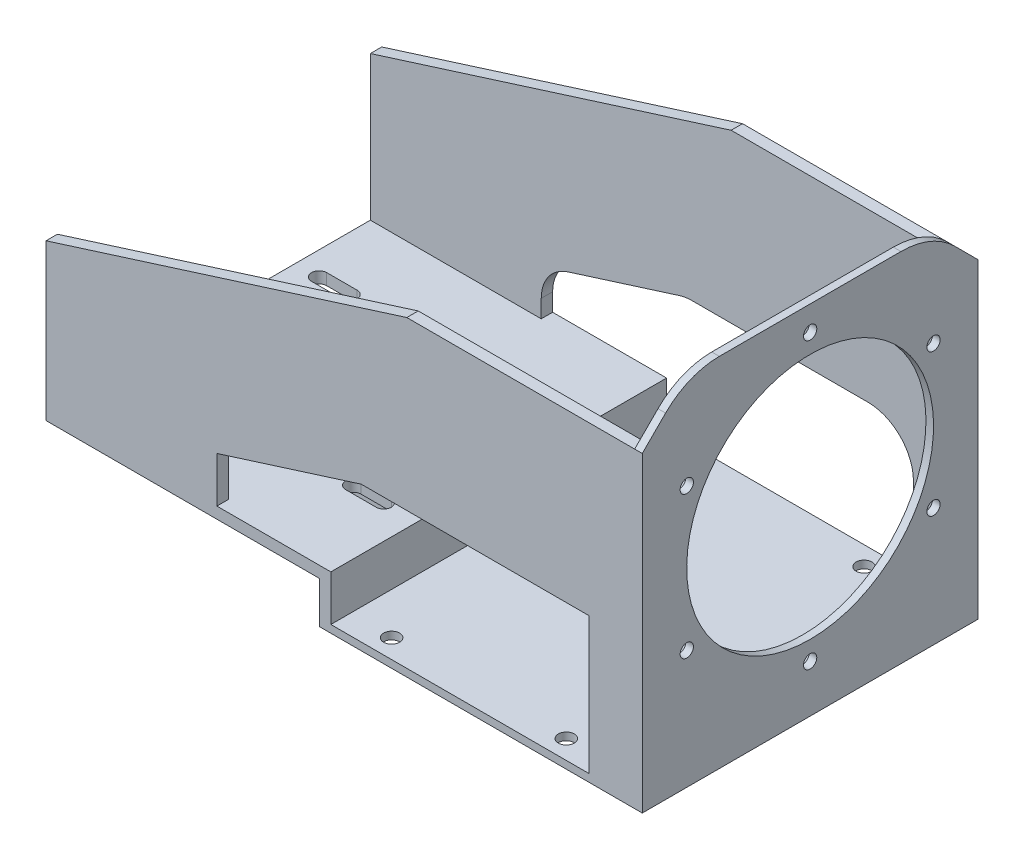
ISO-10303-21;
HEADER;
FILE_DESCRIPTION(('STEP AP214'),'2;1');
FILE_NAME('part.step','',(''),(''),'','','');
FILE_SCHEMA(('AUTOMOTIVE_DESIGN { 1 0 10303 214 1 1 1 1 }'));
ENDSEC;
DATA;
#1=APPLICATION_CONTEXT('core data for automotive mechanical design processes');
#2=APPLICATION_PROTOCOL_DEFINITION('international standard','automotive_design',2000,#1);
#3=PRODUCT_CONTEXT('',#1,'mechanical');
#4=PRODUCT('Part','Part','',(#3));
#5=PRODUCT_RELATED_PRODUCT_CATEGORY('part','',(#4));
#6=PRODUCT_DEFINITION_FORMATION('','',#4);
#7=PRODUCT_DEFINITION_CONTEXT('part definition',#1,'design');
#8=PRODUCT_DEFINITION('design','',#6,#7);
#9=PRODUCT_DEFINITION_SHAPE('','',#8);
#10=(LENGTH_UNIT() NAMED_UNIT(*) SI_UNIT(.MILLI.,.METRE.));
#11=(NAMED_UNIT(*) PLANE_ANGLE_UNIT() SI_UNIT($,.RADIAN.));
#12=(NAMED_UNIT(*) SI_UNIT($,.STERADIAN.) SOLID_ANGLE_UNIT());
#13=UNCERTAINTY_MEASURE_WITH_UNIT(LENGTH_MEASURE(1.E-05),#10,'distance_accuracy_value','');
#14=(GEOMETRIC_REPRESENTATION_CONTEXT(3) GLOBAL_UNCERTAINTY_ASSIGNED_CONTEXT((#13)) GLOBAL_UNIT_ASSIGNED_CONTEXT((#10,
#11,#12)) REPRESENTATION_CONTEXT('',''));
#15=CARTESIAN_POINT('',(0.,0.,0.));
#16=DIRECTION('',(0.,0.,1.));
#17=DIRECTION('',(1.,0.,0.));
#18=AXIS2_PLACEMENT_3D('',#15,#16,#17);
#19=CARTESIAN_POINT('',(-785.,54.9999999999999,585.769667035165));
#20=DIRECTION('',(0.,1.,0.));
#21=DIRECTION('',(-1.,0.,0.));
#22=AXIS2_PLACEMENT_3D('',#19,#20,#21);
#23=PLANE('',#22);
#24=DIRECTION('',(-1.,0.,0.));
#25=VECTOR('',#24,1.);
#26=CARTESIAN_POINT('',(-785.,54.9999999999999,-97.4999999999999));
#27=LINE('',#26,#25);
#28=CARTESIAN_POINT('',(-453.9,54.9999999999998,-97.5));
#29=VERTEX_POINT('',#28);
#30=CARTESIAN_POINT('',(-493.9,54.9999999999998,-97.5));
#31=VERTEX_POINT('',#30);
#32=EDGE_CURVE('E776',#29,#31,#27,.T.);
#33=ORIENTED_EDGE('',*,*,#32,.F.);
#34=CARTESIAN_POINT('',(-453.9,54.9999999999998,-107.5));
#35=DIRECTION('',(0.,1.,0.));
#36=DIRECTION('',(-1.,0.,0.));
#37=AXIS2_PLACEMENT_3D('',#34,#35,#36);
#38=CIRCLE('',#37,9.99999999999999);
#39=CARTESIAN_POINT('',(-453.9,54.9999999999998,-117.5));
#40=VERTEX_POINT('',#39);
#41=EDGE_CURVE('E778',#29,#40,#38,.T.);
#42=ORIENTED_EDGE('',*,*,#41,.T.);
#43=DIRECTION('',(-1.,0.,0.));
#44=VECTOR('',#43,1.);
#45=CARTESIAN_POINT('',(-785.,54.9999999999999,-117.5));
#46=LINE('',#45,#44);
#47=CARTESIAN_POINT('',(-493.9,54.9999999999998,-117.5));
#48=VERTEX_POINT('',#47);
#49=EDGE_CURVE('E756',#40,#48,#46,.T.);
#50=ORIENTED_EDGE('',*,*,#49,.T.);
#51=CARTESIAN_POINT('',(-493.9,54.9999999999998,-107.5));
#52=DIRECTION('',(0.,1.,0.));
#53=DIRECTION('',(-1.,0.,0.));
#54=AXIS2_PLACEMENT_3D('',#51,#52,#53);
#55=CIRCLE('',#54,9.99999999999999);
#56=EDGE_CURVE('E773',#48,#31,#55,.T.);
#57=ORIENTED_EDGE('',*,*,#56,.T.);
#58=EDGE_LOOP('',(#33,#42,#50,#57));
#59=FACE_BOUND('',#58,.T.);
#60=DIRECTION('',(-1.,0.,0.));
#61=VECTOR('',#60,1.);
#62=CARTESIAN_POINT('',(-1045.,54.9999999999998,-97.5));
#63=LINE('',#62,#61);
#64=CARTESIAN_POINT('',(-713.9,54.9999999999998,-97.5000000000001));
#65=VERTEX_POINT('',#64);
#66=CARTESIAN_POINT('',(-753.9,54.9999999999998,-97.5000000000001));
#67=VERTEX_POINT('',#66);
#68=EDGE_CURVE('E487',#65,#67,#63,.T.);
#69=ORIENTED_EDGE('',*,*,#68,.F.);
#70=CARTESIAN_POINT('',(-713.9,54.9999999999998,-107.5));
#71=DIRECTION('',(0.,1.,0.));
#72=DIRECTION('',(-1.,0.,0.));
#73=AXIS2_PLACEMENT_3D('',#70,#71,#72);
#74=CIRCLE('',#73,9.99999999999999);
#75=CARTESIAN_POINT('',(-713.9,54.9999999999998,-117.5));
#76=VERTEX_POINT('',#75);
#77=EDGE_CURVE('E498',#65,#76,#74,.T.);
#78=ORIENTED_EDGE('',*,*,#77,.T.);
#79=DIRECTION('',(-1.,0.,0.));
#80=VECTOR('',#79,1.);
#81=CARTESIAN_POINT('',(-1045.,54.9999999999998,-117.5));
#82=LINE('',#81,#80);
#83=CARTESIAN_POINT('',(-753.9,54.9999999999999,-117.5));
#84=VERTEX_POINT('',#83);
#85=EDGE_CURVE('E470',#76,#84,#82,.T.);
#86=ORIENTED_EDGE('',*,*,#85,.T.);
#87=CARTESIAN_POINT('',(-753.9,54.9999999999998,-107.5));
#88=DIRECTION('',(0.,1.,0.));
#89=DIRECTION('',(-1.,0.,0.));
#90=AXIS2_PLACEMENT_3D('',#87,#88,#89);
#91=CIRCLE('',#90,9.99999999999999);
#92=EDGE_CURVE('E484',#84,#67,#91,.T.);
#93=ORIENTED_EDGE('',*,*,#92,.T.);
#94=EDGE_LOOP('',(#69,#78,#86,#93));
#95=FACE_BOUND('',#94,.T.);
#96=DIRECTION('',(-1.,0.,0.));
#97=VECTOR('',#96,1.);
#98=CARTESIAN_POINT('',(-425.,54.9999999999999,-70.));
#99=LINE('',#98,#97);
#100=CARTESIAN_POINT('',(-425.,54.9999999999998,-70.0000000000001));
#101=VERTEX_POINT('',#100);
#102=CARTESIAN_POINT('',(-785.,54.9999999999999,-70.0000000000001));
#103=VERTEX_POINT('',#102);
#104=EDGE_CURVE('E48',#101,#103,#99,.T.);
#105=ORIENTED_EDGE('',*,*,#104,.T.);
#106=DIRECTION('',(0.,0.,-1.));
#107=VECTOR('',#106,1.);
#108=CARTESIAN_POINT('',(-785.,54.9999999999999,585.769667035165));
#109=LINE('',#108,#107);
#110=CARTESIAN_POINT('',(-785.,54.9999999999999,-221.));
#111=VERTEX_POINT('',#110);
#112=EDGE_CURVE('E639',#103,#111,#109,.T.);
#113=ORIENTED_EDGE('',*,*,#112,.T.);
#114=DIRECTION('',(1.,0.,0.));
#115=VECTOR('',#114,1.);
#116=CARTESIAN_POINT('',(-425.,54.9999999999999,-221.));
#117=LINE('',#116,#115);
#118=CARTESIAN_POINT('',(-425.,54.9999999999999,-221.));
#119=VERTEX_POINT('',#118);
#120=EDGE_CURVE('E543',#111,#119,#117,.T.);
#121=ORIENTED_EDGE('',*,*,#120,.T.);
#122=DIRECTION('',(0.,0.,-1.));
#123=VECTOR('',#122,1.);
#124=CARTESIAN_POINT('',(-425.,54.9999999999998,585.769667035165));
#125=LINE('',#124,#123);
#126=EDGE_CURVE('E643',#101,#119,#125,.T.);
#127=ORIENTED_EDGE('',*,*,#126,.F.);
#128=EDGE_LOOP('',(#105,#113,#121,#127));
#129=FACE_BOUND('',#128,.T.);
#130=ADVANCED_FACE('F33',(#59,#95,#129),#23,.F.);
#131=CARTESIAN_POINT('',(-425.,54.9999999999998,585.769667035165));
#132=DIRECTION('',(1.,0.,0.));
#133=DIRECTION('',(0.,0.,-1.));
#134=AXIS2_PLACEMENT_3D('',#131,#132,#133);
#135=PLANE('',#134);
#136=DIRECTION('',(0.,1.,0.));
#137=VECTOR('',#136,1.);
#138=CARTESIAN_POINT('',(-425.,54.9999999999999,-70.));
#139=LINE('',#138,#137);
#140=CARTESIAN_POINT('',(-425.,-1.2490009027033E-13,-70.));
#141=VERTEX_POINT('',#140);
#142=EDGE_CURVE('E416',#141,#101,#139,.T.);
#143=ORIENTED_EDGE('',*,*,#142,.T.);
#144=ORIENTED_EDGE('',*,*,#126,.T.);
#145=DIRECTION('',(0.,-1.,0.));
#146=VECTOR('',#145,1.);
#147=CARTESIAN_POINT('',(-425.,-1.22464679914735E-13,-221.));
#148=LINE('',#147,#146);
#149=CARTESIAN_POINT('',(-425.,0.,-221.));
#150=VERTEX_POINT('',#149);
#151=EDGE_CURVE('E547',#119,#150,#148,.T.);
#152=ORIENTED_EDGE('',*,*,#151,.T.);
#153=DIRECTION('',(0.,0.,-1.));
#154=VECTOR('',#153,1.);
#155=CARTESIAN_POINT('',(-425.,-1.22464679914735E-13,221.));
#156=LINE('',#155,#154);
#157=EDGE_CURVE('E546',#141,#150,#156,.T.);
#158=ORIENTED_EDGE('',*,*,#157,.F.);
#159=EDGE_LOOP('',(#143,#144,#152,#158));
#160=FACE_BOUND('',#159,.T.);
#161=ADVANCED_FACE('F987',(#160),#135,.F.);
#162=CARTESIAN_POINT('',(-713.9,54.9999999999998,107.5));
#163=DIRECTION('',(0.,1.,0.));
#164=DIRECTION('',(-1.,0.,0.));
#165=AXIS2_PLACEMENT_3D('',#162,#163,#164);
#166=CIRCLE('',#165,9.99999999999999);
#167=CARTESIAN_POINT('',(-713.9,54.9999999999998,117.5));
#168=VERTEX_POINT('',#167);
#169=CARTESIAN_POINT('',(-713.9,54.9999999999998,97.4999999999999));
#170=VERTEX_POINT('',#169);
#171=EDGE_CURVE('E822',#168,#170,#166,.T.);
#172=ORIENTED_EDGE('',*,*,#171,.T.);
#173=DIRECTION('',(-1.,0.,0.));
#174=VECTOR('',#173,1.);
#175=CARTESIAN_POINT('',(-1045.,54.9999999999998,97.5000000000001));
#176=LINE('',#175,#174);
#177=CARTESIAN_POINT('',(-753.9,54.9999999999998,97.5));
#178=VERTEX_POINT('',#177);
#179=EDGE_CURVE('E824',#170,#178,#176,.T.);
#180=ORIENTED_EDGE('',*,*,#179,.T.);
#181=CARTESIAN_POINT('',(-753.9,54.9999999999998,107.5));
#182=DIRECTION('',(0.,1.,0.));
#183=DIRECTION('',(-1.,0.,0.));
#184=AXIS2_PLACEMENT_3D('',#181,#182,#183);
#185=CIRCLE('',#184,9.99999999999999);
#186=CARTESIAN_POINT('',(-753.9,54.9999999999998,117.5));
#187=VERTEX_POINT('',#186);
#188=EDGE_CURVE('E826',#178,#187,#185,.T.);
#189=ORIENTED_EDGE('',*,*,#188,.T.);
#190=DIRECTION('',(-1.,0.,0.));
#191=VECTOR('',#190,1.);
#192=CARTESIAN_POINT('',(-1045.,54.9999999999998,117.5));
#193=LINE('',#192,#191);
#194=EDGE_CURVE('E828',#168,#187,#193,.T.);
#195=ORIENTED_EDGE('',*,*,#194,.F.);
#196=EDGE_LOOP('',(#172,#180,#189,#195));
#197=FACE_BOUND('',#196,.T.);
#198=CARTESIAN_POINT('',(-453.9,54.9999999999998,107.5));
#199=DIRECTION('',(0.,1.,0.));
#200=DIRECTION('',(-1.,0.,0.));
#201=AXIS2_PLACEMENT_3D('',#198,#199,#200);
#202=CIRCLE('',#201,9.99999999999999);
#203=CARTESIAN_POINT('',(-453.9,54.9999999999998,117.5));
#204=VERTEX_POINT('',#203);
#205=CARTESIAN_POINT('',(-453.9,54.9999999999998,97.5));
#206=VERTEX_POINT('',#205);
#207=EDGE_CURVE('E791',#204,#206,#202,.T.);
#208=ORIENTED_EDGE('',*,*,#207,.T.);
#209=DIRECTION('',(-1.,0.,0.));
#210=VECTOR('',#209,1.);
#211=CARTESIAN_POINT('',(-785.,54.9999999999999,97.5000000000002));
#212=LINE('',#211,#210);
#213=CARTESIAN_POINT('',(-493.9,54.9999999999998,97.5000000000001));
#214=VERTEX_POINT('',#213);
#215=EDGE_CURVE('E793',#206,#214,#212,.T.);
#216=ORIENTED_EDGE('',*,*,#215,.T.);
#217=CARTESIAN_POINT('',(-493.9,54.9999999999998,107.5));
#218=DIRECTION('',(0.,1.,0.));
#219=DIRECTION('',(-1.,0.,0.));
#220=AXIS2_PLACEMENT_3D('',#217,#218,#219);
#221=CIRCLE('',#220,9.99999999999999);
#222=CARTESIAN_POINT('',(-493.9,54.9999999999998,117.5));
#223=VERTEX_POINT('',#222);
#224=EDGE_CURVE('E795',#214,#223,#221,.T.);
#225=ORIENTED_EDGE('',*,*,#224,.T.);
#226=DIRECTION('',(-1.,0.,0.));
#227=VECTOR('',#226,1.);
#228=CARTESIAN_POINT('',(-785.,54.9999999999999,117.5));
#229=LINE('',#228,#227);
#230=EDGE_CURVE('E797',#204,#223,#229,.T.);
#231=ORIENTED_EDGE('',*,*,#230,.F.);
#232=EDGE_LOOP('',(#208,#216,#225,#231));
#233=FACE_BOUND('',#232,.T.);
#234=DIRECTION('',(-1.,0.,0.));
#235=VECTOR('',#234,1.);
#236=CARTESIAN_POINT('',(-425.,54.9999999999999,70.));
#237=LINE('',#236,#235);
#238=CARTESIAN_POINT('',(-425.,54.9999999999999,70.));
#239=VERTEX_POINT('',#238);
#240=CARTESIAN_POINT('',(-785.,54.9999999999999,70.0000000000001));
#241=VERTEX_POINT('',#240);
#242=EDGE_CURVE('E435',#239,#241,#237,.T.);
#243=ORIENTED_EDGE('',*,*,#242,.F.);
#244=CARTESIAN_POINT('',(-425.,54.9999999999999,221.));
#245=VERTEX_POINT('',#244);
#246=EDGE_CURVE('E640',#245,#239,#125,.T.);
#247=ORIENTED_EDGE('',*,*,#246,.F.);
#248=DIRECTION('',(1.,0.,0.));
#249=VECTOR('',#248,1.);
#250=CARTESIAN_POINT('',(-425.,54.9999999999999,221.));
#251=LINE('',#250,#249);
#252=CARTESIAN_POINT('',(-785.,54.9999999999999,221.));
#253=VERTEX_POINT('',#252);
#254=EDGE_CURVE('E542',#253,#245,#251,.T.);
#255=ORIENTED_EDGE('',*,*,#254,.F.);
#256=EDGE_CURVE('E637',#253,#241,#109,.T.);
#257=ORIENTED_EDGE('',*,*,#256,.T.);
#258=EDGE_LOOP('',(#243,#247,#255,#257));
#259=FACE_BOUND('',#258,.T.);
#260=ADVANCED_FACE('F990',(#197,#233,#259),#23,.F.);
#261=DIRECTION('',(0.,1.,0.));
#262=VECTOR('',#261,1.);
#263=CARTESIAN_POINT('',(-425.,54.9999999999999,70.));
#264=LINE('',#263,#262);
#265=CARTESIAN_POINT('',(-425.,-1.22464679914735E-13,70.0000000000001));
#266=VERTEX_POINT('',#265);
#267=EDGE_CURVE('E404',#266,#239,#264,.T.);
#268=ORIENTED_EDGE('',*,*,#267,.F.);
#269=CARTESIAN_POINT('',(-425.,-1.22464679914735E-13,221.));
#270=VERTEX_POINT('',#269);
#271=EDGE_CURVE('E552',#270,#266,#156,.T.);
#272=ORIENTED_EDGE('',*,*,#271,.F.);
#273=DIRECTION('',(0.,-1.,0.));
#274=VECTOR('',#273,1.);
#275=CARTESIAN_POINT('',(-425.,-1.22464679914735E-13,221.));
#276=LINE('',#275,#274);
#277=EDGE_CURVE('E539',#245,#270,#276,.T.);
#278=ORIENTED_EDGE('',*,*,#277,.F.);
#279=ORIENTED_EDGE('',*,*,#246,.T.);
#280=EDGE_LOOP('',(#268,#272,#278,#279));
#281=FACE_BOUND('',#280,.T.);
#282=ADVANCED_FACE('F997',(#281),#135,.F.);
#283=CARTESIAN_POINT('',(-713.9,-1.86887542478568E-13,97.4999999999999));
#284=DIRECTION('',(0.,0.,-1.));
#285=DIRECTION('',(-1.,0.,0.));
#286=AXIS2_PLACEMENT_3D('',#283,#284,#285);
#287=PLANE('',#286);
#288=DIRECTION('',(0.,1.,0.));
#289=VECTOR('',#288,1.);
#290=CARTESIAN_POINT('',(-713.9,-1.86887542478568E-13,97.4999999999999));
#291=LINE('',#290,#289);
#292=CARTESIAN_POINT('',(-713.9,69.9999999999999,97.5));
#293=VERTEX_POINT('',#292);
#294=EDGE_CURVE('E834',#170,#293,#291,.T.);
#295=ORIENTED_EDGE('',*,*,#294,.T.);
#296=DIRECTION('',(-1.,0.,0.));
#297=VECTOR('',#296,1.);
#298=CARTESIAN_POINT('',(-713.9,69.9999999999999,97.4999999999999));
#299=LINE('',#298,#297);
#300=CARTESIAN_POINT('',(-753.9,69.9999999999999,97.4999999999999));
#301=VERTEX_POINT('',#300);
#302=EDGE_CURVE('E819',#293,#301,#299,.T.);
#303=ORIENTED_EDGE('',*,*,#302,.T.);
#304=DIRECTION('',(0.,1.,0.));
#305=VECTOR('',#304,1.);
#306=CARTESIAN_POINT('',(-753.9,-1.86887542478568E-13,97.4999999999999));
#307=LINE('',#306,#305);
#308=EDGE_CURVE('E840',#178,#301,#307,.T.);
#309=ORIENTED_EDGE('',*,*,#308,.F.);
#310=ORIENTED_EDGE('',*,*,#179,.F.);
#311=EDGE_LOOP('',(#295,#303,#309,#310));
#312=FACE_BOUND('',#311,.T.);
#313=ADVANCED_FACE('F1182',(#312),#287,.F.);
#314=CARTESIAN_POINT('',(-753.9,-1.86887542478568E-13,107.5));
#315=DIRECTION('',(0.,1.,0.));
#316=DIRECTION('',(-1.,0.,0.));
#317=AXIS2_PLACEMENT_3D('',#314,#315,#316);
#318=CYLINDRICAL_SURFACE('',#317,9.99999999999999);
#319=ORIENTED_EDGE('',*,*,#308,.T.);
#320=CARTESIAN_POINT('',(-753.9,69.9999999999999,107.5));
#321=DIRECTION('',(0.,1.,0.));
#322=DIRECTION('',(-1.,0.,0.));
#323=AXIS2_PLACEMENT_3D('',#320,#321,#322);
#324=CIRCLE('',#323,9.99999999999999);
#325=CARTESIAN_POINT('',(-753.9,69.9999999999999,117.5));
#326=VERTEX_POINT('',#325);
#327=EDGE_CURVE('E816',#301,#326,#324,.T.);
#328=ORIENTED_EDGE('',*,*,#327,.T.);
#329=DIRECTION('',(0.,1.,0.));
#330=VECTOR('',#329,1.);
#331=CARTESIAN_POINT('',(-753.9,-1.86887542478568E-13,117.5));
#332=LINE('',#331,#330);
#333=EDGE_CURVE('E837',#187,#326,#332,.T.);
#334=ORIENTED_EDGE('',*,*,#333,.F.);
#335=ORIENTED_EDGE('',*,*,#188,.F.);
#336=EDGE_LOOP('',(#319,#328,#334,#335));
#337=FACE_BOUND('',#336,.T.);
#338=ADVANCED_FACE('F1189',(#337),#318,.F.);
#339=CARTESIAN_POINT('',(-713.9,-1.86887542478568E-13,117.5));
#340=DIRECTION('',(0.,0.,-1.));
#341=DIRECTION('',(-1.,0.,0.));
#342=AXIS2_PLACEMENT_3D('',#339,#340,#341);
#343=PLANE('',#342);
#344=ORIENTED_EDGE('',*,*,#194,.T.);
#345=ORIENTED_EDGE('',*,*,#333,.T.);
#346=DIRECTION('',(-1.,0.,0.));
#347=VECTOR('',#346,1.);
#348=CARTESIAN_POINT('',(-713.9,69.9999999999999,117.5));
#349=LINE('',#348,#347);
#350=CARTESIAN_POINT('',(-713.9,69.9999999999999,117.5));
#351=VERTEX_POINT('',#350);
#352=EDGE_CURVE('E814',#351,#326,#349,.T.);
#353=ORIENTED_EDGE('',*,*,#352,.F.);
#354=DIRECTION('',(0.,1.,0.));
#355=VECTOR('',#354,1.);
#356=CARTESIAN_POINT('',(-713.9,-1.86887542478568E-13,117.5));
#357=LINE('',#356,#355);
#358=EDGE_CURVE('E831',#168,#351,#357,.T.);
#359=ORIENTED_EDGE('',*,*,#358,.F.);
#360=EDGE_LOOP('',(#344,#345,#353,#359));
#361=FACE_BOUND('',#360,.T.);
#362=ADVANCED_FACE('F1198',(#361),#343,.T.);
#363=CARTESIAN_POINT('',(-713.9,-1.86887542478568E-13,107.5));
#364=DIRECTION('',(0.,1.,0.));
#365=DIRECTION('',(-1.,0.,0.));
#366=AXIS2_PLACEMENT_3D('',#363,#364,#365);
#367=CYLINDRICAL_SURFACE('',#366,9.99999999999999);
#368=ORIENTED_EDGE('',*,*,#358,.T.);
#369=CARTESIAN_POINT('',(-713.9,69.9999999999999,107.5));
#370=DIRECTION('',(0.,1.,0.));
#371=DIRECTION('',(-1.,0.,0.));
#372=AXIS2_PLACEMENT_3D('',#369,#370,#371);
#373=CIRCLE('',#372,9.99999999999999);
#374=EDGE_CURVE('E812',#351,#293,#373,.T.);
#375=ORIENTED_EDGE('',*,*,#374,.T.);
#376=ORIENTED_EDGE('',*,*,#294,.F.);
#377=ORIENTED_EDGE('',*,*,#171,.F.);
#378=EDGE_LOOP('',(#368,#375,#376,#377));
#379=FACE_BOUND('',#378,.T.);
#380=ADVANCED_FACE('F1206',(#379),#367,.F.);
#381=CARTESIAN_POINT('',(-453.9,-1.38777878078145E-13,97.5));
#382=DIRECTION('',(0.,0.,-1.));
#383=DIRECTION('',(-1.,0.,0.));
#384=AXIS2_PLACEMENT_3D('',#381,#382,#383);
#385=PLANE('',#384);
#386=DIRECTION('',(0.,1.,0.));
#387=VECTOR('',#386,1.);
#388=CARTESIAN_POINT('',(-453.9,-1.38777878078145E-13,97.5));
#389=LINE('',#388,#387);
#390=CARTESIAN_POINT('',(-453.9,69.9999999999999,97.5000000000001));
#391=VERTEX_POINT('',#390);
#392=EDGE_CURVE('E803',#206,#391,#389,.T.);
#393=ORIENTED_EDGE('',*,*,#392,.T.);
#394=DIRECTION('',(-1.,0.,0.));
#395=VECTOR('',#394,1.);
#396=CARTESIAN_POINT('',(-453.9,69.9999999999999,97.5));
#397=LINE('',#396,#395);
#398=CARTESIAN_POINT('',(-493.9,69.9999999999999,97.5));
#399=VERTEX_POINT('',#398);
#400=EDGE_CURVE('E788',#391,#399,#397,.T.);
#401=ORIENTED_EDGE('',*,*,#400,.T.);
#402=DIRECTION('',(0.,1.,0.));
#403=VECTOR('',#402,1.);
#404=CARTESIAN_POINT('',(-493.9,-1.38777878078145E-13,97.5));
#405=LINE('',#404,#403);
#406=EDGE_CURVE('E809',#214,#399,#405,.T.);
#407=ORIENTED_EDGE('',*,*,#406,.F.);
#408=ORIENTED_EDGE('',*,*,#215,.F.);
#409=EDGE_LOOP('',(#393,#401,#407,#408));
#410=FACE_BOUND('',#409,.T.);
#411=ADVANCED_FACE('F1214',(#410),#385,.F.);
#412=CARTESIAN_POINT('',(-493.9,-1.38777878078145E-13,107.5));
#413=DIRECTION('',(0.,1.,0.));
#414=DIRECTION('',(-1.,0.,0.));
#415=AXIS2_PLACEMENT_3D('',#412,#413,#414);
#416=CYLINDRICAL_SURFACE('',#415,9.99999999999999);
#417=ORIENTED_EDGE('',*,*,#406,.T.);
#418=CARTESIAN_POINT('',(-493.9,69.9999999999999,107.5));
#419=DIRECTION('',(0.,1.,0.));
#420=DIRECTION('',(-1.,0.,0.));
#421=AXIS2_PLACEMENT_3D('',#418,#419,#420);
#422=CIRCLE('',#421,9.99999999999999);
#423=CARTESIAN_POINT('',(-493.9,69.9999999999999,117.5));
#424=VERTEX_POINT('',#423);
#425=EDGE_CURVE('E785',#399,#424,#422,.T.);
#426=ORIENTED_EDGE('',*,*,#425,.T.);
#427=DIRECTION('',(0.,1.,0.));
#428=VECTOR('',#427,1.);
#429=CARTESIAN_POINT('',(-493.9,-1.38777878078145E-13,117.5));
#430=LINE('',#429,#428);
#431=EDGE_CURVE('E806',#223,#424,#430,.T.);
#432=ORIENTED_EDGE('',*,*,#431,.F.);
#433=ORIENTED_EDGE('',*,*,#224,.F.);
#434=EDGE_LOOP('',(#417,#426,#432,#433));
#435=FACE_BOUND('',#434,.T.);
#436=ADVANCED_FACE('F1222',(#435),#416,.F.);
#437=CARTESIAN_POINT('',(-453.9,-1.38777878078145E-13,117.5));
#438=DIRECTION('',(0.,0.,-1.));
#439=DIRECTION('',(-1.,0.,0.));
#440=AXIS2_PLACEMENT_3D('',#437,#438,#439);
#441=PLANE('',#440);
#442=ORIENTED_EDGE('',*,*,#230,.T.);
#443=ORIENTED_EDGE('',*,*,#431,.T.);
#444=DIRECTION('',(-1.,0.,0.));
#445=VECTOR('',#444,1.);
#446=CARTESIAN_POINT('',(-453.9,69.9999999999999,117.5));
#447=LINE('',#446,#445);
#448=CARTESIAN_POINT('',(-453.9,69.9999999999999,117.5));
#449=VERTEX_POINT('',#448);
#450=EDGE_CURVE('E783',#449,#424,#447,.T.);
#451=ORIENTED_EDGE('',*,*,#450,.F.);
#452=DIRECTION('',(0.,1.,0.));
#453=VECTOR('',#452,1.);
#454=CARTESIAN_POINT('',(-453.9,-1.38777878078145E-13,117.5));
#455=LINE('',#454,#453);
#456=EDGE_CURVE('E800',#204,#449,#455,.T.);
#457=ORIENTED_EDGE('',*,*,#456,.F.);
#458=EDGE_LOOP('',(#442,#443,#451,#457));
#459=FACE_BOUND('',#458,.T.);
#460=ADVANCED_FACE('F1230',(#459),#441,.T.);
#461=CARTESIAN_POINT('',(-453.9,-1.38777878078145E-13,107.5));
#462=DIRECTION('',(0.,1.,0.));
#463=DIRECTION('',(-1.,0.,0.));
#464=AXIS2_PLACEMENT_3D('',#461,#462,#463);
#465=CYLINDRICAL_SURFACE('',#464,9.99999999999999);
#466=ORIENTED_EDGE('',*,*,#456,.T.);
#467=CARTESIAN_POINT('',(-453.9,69.9999999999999,107.5));
#468=DIRECTION('',(0.,1.,0.));
#469=DIRECTION('',(-1.,0.,0.));
#470=AXIS2_PLACEMENT_3D('',#467,#468,#469);
#471=CIRCLE('',#470,9.99999999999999);
#472=EDGE_CURVE('E781',#449,#391,#471,.T.);
#473=ORIENTED_EDGE('',*,*,#472,.T.);
#474=ORIENTED_EDGE('',*,*,#392,.F.);
#475=ORIENTED_EDGE('',*,*,#207,.F.);
#476=EDGE_LOOP('',(#466,#473,#474,#475));
#477=FACE_BOUND('',#476,.T.);
#478=ADVANCED_FACE('F1238',(#477),#465,.F.);
#479=CARTESIAN_POINT('',(0.,0.,221.));
#480=DIRECTION('',(0.,0.,-1.));
#481=DIRECTION('',(-1.,0.,0.));
#482=AXIS2_PLACEMENT_3D('',#479,#480,#481);
#483=PLANE('',#482);
#484=ORIENTED_EDGE('',*,*,#254,.T.);
#485=ORIENTED_EDGE('',*,*,#277,.T.);
#486=DIRECTION('',(1.,0.,0.));
#487=VECTOR('',#486,1.);
#488=CARTESIAN_POINT('',(0.,0.,221.));
#489=LINE('',#488,#487);
#490=CARTESIAN_POINT('',(0.,0.,221.));
#491=VERTEX_POINT('',#490);
#492=EDGE_CURVE('E729',#270,#491,#489,.T.);
#493=ORIENTED_EDGE('',*,*,#492,.T.);
#494=DIRECTION('',(0.,1.,0.));
#495=VECTOR('',#494,1.);
#496=CARTESIAN_POINT('',(0.,250.,221.));
#497=LINE('',#496,#495);
#498=CARTESIAN_POINT('',(0.,410.,221.));
#499=VERTEX_POINT('',#498);
#500=EDGE_CURVE('E732',#491,#499,#497,.T.);
#501=ORIENTED_EDGE('',*,*,#500,.T.);
#502=DIRECTION('',(1.,0.,0.));
#503=VECTOR('',#502,1.);
#504=CARTESIAN_POINT('',(-10.,410.,221.));
#505=LINE('',#504,#503);
#506=CARTESIAN_POINT('',(-10.,410.,221.));
#507=VERTEX_POINT('',#506);
#508=EDGE_CURVE('E710',#507,#499,#505,.T.);
#509=ORIENTED_EDGE('',*,*,#508,.F.);
#510=DIRECTION('',(-1.,0.,0.));
#511=VECTOR('',#510,1.);
#512=CARTESIAN_POINT('',(-10.,410.,221.));
#513=LINE('',#512,#511);
#514=CARTESIAN_POINT('',(-310.,410.,221.));
#515=VERTEX_POINT('',#514);
#516=EDGE_CURVE('E629',#507,#515,#513,.T.);
#517=ORIENTED_EDGE('',*,*,#516,.T.);
#518=DIRECTION('',(-0.953582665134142,-0.301131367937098,0.));
#519=VECTOR('',#518,1.);
#520=CARTESIAN_POINT('',(-310.,410.,221.));
#521=LINE('',#520,#519);
#522=CARTESIAN_POINT('',(-785.,260.,221.));
#523=VERTEX_POINT('',#522);
#524=EDGE_CURVE('E649',#515,#523,#521,.T.);
#525=ORIENTED_EDGE('',*,*,#524,.T.);
#526=DIRECTION('',(0.,-1.,0.));
#527=VECTOR('',#526,1.);
#528=CARTESIAN_POINT('',(-785.,0.,221.));
#529=LINE('',#528,#527);
#530=EDGE_CURVE('E726',#523,#253,#529,.T.);
#531=ORIENTED_EDGE('',*,*,#530,.T.);
#532=EDGE_LOOP('',(#484,#485,#493,#501,#509,#517,#525,#531));
#533=FACE_BOUND('',#532,.T.);
#534=DIRECTION('',(-1.,0.,0.));
#535=VECTOR('',#534,1.);
#536=CARTESIAN_POINT('',(-70.,190.,221.));
#537=LINE('',#536,#535);
#538=CARTESIAN_POINT('',(-70.,190.,221.));
#539=VERTEX_POINT('',#538);
#540=CARTESIAN_POINT('',(-370.,190.,221.));
#541=VERTEX_POINT('',#540);
#542=EDGE_CURVE('E559',#539,#541,#537,.T.);
#543=ORIENTED_EDGE('',*,*,#542,.F.);
#544=DIRECTION('',(0.,-1.,0.));
#545=VECTOR('',#544,1.);
#546=CARTESIAN_POINT('',(-70.,190.,221.));
#547=LINE('',#546,#545);
#548=CARTESIAN_POINT('',(-70.,9.99999999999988,221.));
#549=VERTEX_POINT('',#548);
#550=EDGE_CURVE('E575',#539,#549,#547,.T.);
#551=ORIENTED_EDGE('',*,*,#550,.T.);
#552=DIRECTION('',(-1.,0.,0.));
#553=VECTOR('',#552,1.);
#554=CARTESIAN_POINT('',(-70.,9.99999999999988,221.));
#555=LINE('',#554,#553);
#556=CARTESIAN_POINT('',(-410.,9.99999999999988,221.));
#557=VERTEX_POINT('',#556);
#558=EDGE_CURVE('E572',#549,#557,#555,.T.);
#559=ORIENTED_EDGE('',*,*,#558,.T.);
#560=DIRECTION('',(0.,-1.,0.));
#561=VECTOR('',#560,1.);
#562=CARTESIAN_POINT('',(-410.,69.9999999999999,221.));
#563=LINE('',#562,#561);
#564=CARTESIAN_POINT('',(-410.,69.9999999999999,221.));
#565=VERTEX_POINT('',#564);
#566=EDGE_CURVE('E569',#565,#557,#563,.T.);
#567=ORIENTED_EDGE('',*,*,#566,.F.);
#568=DIRECTION('',(1.,0.,0.));
#569=VECTOR('',#568,1.);
#570=CARTESIAN_POINT('',(-560.,69.9999999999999,221.));
#571=LINE('',#570,#569);
#572=CARTESIAN_POINT('',(-560.,69.9999999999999,221.));
#573=VERTEX_POINT('',#572);
#574=EDGE_CURVE('E566',#573,#565,#571,.T.);
#575=ORIENTED_EDGE('',*,*,#574,.F.);
#576=DIRECTION('',(0.,-1.,0.));
#577=VECTOR('',#576,1.);
#578=CARTESIAN_POINT('',(-560.,130.,221.));
#579=LINE('',#578,#577);
#580=CARTESIAN_POINT('',(-560.,130.,221.));
#581=VERTEX_POINT('',#580);
#582=EDGE_CURVE('E564',#581,#573,#579,.T.);
#583=ORIENTED_EDGE('',*,*,#582,.F.);
#584=DIRECTION('',(-0.953582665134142,-0.301131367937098,0.));
#585=VECTOR('',#584,1.);
#586=CARTESIAN_POINT('',(-370.,190.,221.));
#587=LINE('',#586,#585);
#588=EDGE_CURVE('E561',#541,#581,#587,.T.);
#589=ORIENTED_EDGE('',*,*,#588,.F.);
#590=EDGE_LOOP('',(#543,#551,#559,#567,#575,#583,#589));
#591=FACE_BOUND('',#590,.T.);
#592=ADVANCED_FACE('F938',(#533,#591),#483,.F.);
#593=CARTESIAN_POINT('',(0.,0.,-221.));
#594=DIRECTION('',(0.,0.,-1.));
#595=DIRECTION('',(-1.,0.,0.));
#596=AXIS2_PLACEMENT_3D('',#593,#594,#595);
#597=PLANE('',#596);
#598=ORIENTED_EDGE('',*,*,#151,.F.);
#599=ORIENTED_EDGE('',*,*,#120,.F.);
#600=DIRECTION('',(0.,-1.,0.));
#601=VECTOR('',#600,1.);
#602=CARTESIAN_POINT('',(-785.,0.,-221.));
#603=LINE('',#602,#601);
#604=CARTESIAN_POINT('',(-785.,260.,-221.));
#605=VERTEX_POINT('',#604);
#606=EDGE_CURVE('E725',#605,#111,#603,.T.);
#607=ORIENTED_EDGE('',*,*,#606,.F.);
#608=DIRECTION('',(-0.953582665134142,-0.301131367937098,0.));
#609=VECTOR('',#608,1.);
#610=CARTESIAN_POINT('',(-310.,410.,-221.));
#611=LINE('',#610,#609);
#612=CARTESIAN_POINT('',(-310.,410.,-221.));
#613=VERTEX_POINT('',#612);
#614=EDGE_CURVE('E677',#613,#605,#611,.T.);
#615=ORIENTED_EDGE('',*,*,#614,.F.);
#616=DIRECTION('',(-1.,0.,0.));
#617=VECTOR('',#616,1.);
#618=CARTESIAN_POINT('',(-10.,410.,-221.));
#619=LINE('',#618,#617);
#620=CARTESIAN_POINT('',(-10.,410.,-221.));
#621=VERTEX_POINT('',#620);
#622=EDGE_CURVE('E672',#621,#613,#619,.T.);
#623=ORIENTED_EDGE('',*,*,#622,.F.);
#624=DIRECTION('',(1.,0.,0.));
#625=VECTOR('',#624,1.);
#626=CARTESIAN_POINT('',(-10.,410.,-221.));
#627=LINE('',#626,#625);
#628=CARTESIAN_POINT('',(0.,410.,-221.));
#629=VERTEX_POINT('',#628);
#630=EDGE_CURVE('E717',#621,#629,#627,.T.);
#631=ORIENTED_EDGE('',*,*,#630,.T.);
#632=DIRECTION('',(0.,1.,0.));
#633=VECTOR('',#632,1.);
#634=CARTESIAN_POINT('',(0.,250.,-221.));
#635=LINE('',#634,#633);
#636=CARTESIAN_POINT('',(0.,0.,-221.));
#637=VERTEX_POINT('',#636);
#638=EDGE_CURVE('E730',#637,#629,#635,.T.);
#639=ORIENTED_EDGE('',*,*,#638,.F.);
#640=DIRECTION('',(1.,0.,0.));
#641=VECTOR('',#640,1.);
#642=CARTESIAN_POINT('',(0.,0.,-221.));
#643=LINE('',#642,#641);
#644=EDGE_CURVE('E737',#150,#637,#643,.T.);
#645=ORIENTED_EDGE('',*,*,#644,.F.);
#646=EDGE_LOOP('',(#598,#599,#607,#615,#623,#631,#639,#645));
#647=FACE_BOUND('',#646,.T.);
#648=DIRECTION('',(0.,-1.,0.));
#649=VECTOR('',#648,1.);
#650=CARTESIAN_POINT('',(-70.,190.,-221.));
#651=LINE('',#650,#649);
#652=CARTESIAN_POINT('',(-70.,130.,-221.));
#653=VERTEX_POINT('',#652);
#654=CARTESIAN_POINT('',(-70.,9.99999999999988,-221.));
#655=VERTEX_POINT('',#654);
#656=EDGE_CURVE('E562',#653,#655,#651,.T.);
#657=ORIENTED_EDGE('',*,*,#656,.F.);
#658=CARTESIAN_POINT('',(-130.,130.,-221.));
#659=DIRECTION('',(0.,0.,-1.));
#660=DIRECTION('',(-1.,0.,0.));
#661=AXIS2_PLACEMENT_3D('',#658,#659,#660);
#662=CIRCLE('',#661,60.);
#663=CARTESIAN_POINT('',(-130.,190.,-221.));
#664=VERTEX_POINT('',#663);
#665=EDGE_CURVE('E867',#653,#664,#662,.F.);
#666=ORIENTED_EDGE('',*,*,#665,.T.);
#667=DIRECTION('',(-1.,0.,0.));
#668=VECTOR('',#667,1.);
#669=CARTESIAN_POINT('',(-70.,190.,-221.));
#670=LINE('',#669,#668);
#671=CARTESIAN_POINT('',(-362.292842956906,190.,-221.));
#672=VERTEX_POINT('',#671);
#673=EDGE_CURVE('E579',#664,#672,#670,.T.);
#674=ORIENTED_EDGE('',*,*,#673,.T.);
#675=CARTESIAN_POINT('',(-362.292842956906,140.,-221.));
#676=DIRECTION('',(0.,0.,-1.));
#677=DIRECTION('',(-1.,0.,0.));
#678=AXIS2_PLACEMENT_3D('',#675,#676,#677);
#679=CIRCLE('',#678,50.);
#680=CARTESIAN_POINT('',(-377.349411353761,187.679133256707,-221.));
#681=VERTEX_POINT('',#680);
#682=EDGE_CURVE('E881',#672,#681,#679,.F.);
#683=ORIENTED_EDGE('',*,*,#682,.T.);
#684=DIRECTION('',(-0.953582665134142,-0.301131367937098,0.));
#685=VECTOR('',#684,1.);
#686=CARTESIAN_POINT('',(-370.,190.,-221.));
#687=LINE('',#686,#685);
#688=CARTESIAN_POINT('',(-525.056568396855,141.034767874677,-221.));
#689=VERTEX_POINT('',#688);
#690=EDGE_CURVE('E582',#681,#689,#687,.T.);
#691=ORIENTED_EDGE('',*,*,#690,.T.);
#692=CARTESIAN_POINT('',(-510.,93.3556346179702,-221.));
#693=DIRECTION('',(0.,0.,-1.));
#694=DIRECTION('',(-1.,0.,0.));
#695=AXIS2_PLACEMENT_3D('',#692,#693,#694);
#696=CIRCLE('',#695,50.);
#697=CARTESIAN_POINT('',(-560.,93.3556346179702,-221.));
#698=VERTEX_POINT('',#697);
#699=EDGE_CURVE('E41',#689,#698,#696,.F.);
#700=ORIENTED_EDGE('',*,*,#699,.T.);
#701=DIRECTION('',(0.,-1.,0.));
#702=VECTOR('',#701,1.);
#703=CARTESIAN_POINT('',(-560.,130.,-221.));
#704=LINE('',#703,#702);
#705=CARTESIAN_POINT('',(-560.,69.9999999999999,-221.));
#706=VERTEX_POINT('',#705);
#707=EDGE_CURVE('E585',#698,#706,#704,.T.);
#708=ORIENTED_EDGE('',*,*,#707,.T.);
#709=DIRECTION('',(1.,0.,0.));
#710=VECTOR('',#709,1.);
#711=CARTESIAN_POINT('',(-560.,69.9999999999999,-221.));
#712=LINE('',#711,#710);
#713=CARTESIAN_POINT('',(-410.,69.9999999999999,-221.));
#714=VERTEX_POINT('',#713);
#715=EDGE_CURVE('E587',#706,#714,#712,.T.);
#716=ORIENTED_EDGE('',*,*,#715,.T.);
#717=DIRECTION('',(0.,-1.,0.));
#718=VECTOR('',#717,1.);
#719=CARTESIAN_POINT('',(-410.,69.9999999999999,-221.));
#720=LINE('',#719,#718);
#721=CARTESIAN_POINT('',(-410.,9.99999999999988,-221.));
#722=VERTEX_POINT('',#721);
#723=EDGE_CURVE('E590',#714,#722,#720,.T.);
#724=ORIENTED_EDGE('',*,*,#723,.T.);
#725=DIRECTION('',(-1.,0.,0.));
#726=VECTOR('',#725,1.);
#727=CARTESIAN_POINT('',(-70.,9.99999999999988,-221.));
#728=LINE('',#727,#726);
#729=EDGE_CURVE('E593',#655,#722,#728,.T.);
#730=ORIENTED_EDGE('',*,*,#729,.F.);
#731=EDGE_LOOP('',(#657,#666,#674,#683,#691,#700,#708,#716,#724,#730));
#732=FACE_BOUND('',#731,.T.);
#733=ADVANCED_FACE('F887',(#647,#732),#597,.T.);
#734=CARTESIAN_POINT('',(0.,0.,-206.));
#735=DIRECTION('',(0.,0.,1.));
#736=DIRECTION('',(1.,0.,0.));
#737=AXIS2_PLACEMENT_3D('',#734,#735,#736);
#738=PLANE('',#737);
#739=DIRECTION('',(-1.,0.,0.));
#740=VECTOR('',#739,1.);
#741=CARTESIAN_POINT('',(-410.,69.9999999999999,-206.));
#742=LINE('',#741,#740);
#743=CARTESIAN_POINT('',(-560.,69.9999999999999,-206.));
#744=VERTEX_POINT('',#743);
#745=CARTESIAN_POINT('',(-785.,69.9999999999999,-206.));
#746=VERTEX_POINT('',#745);
#747=EDGE_CURVE('E625',#744,#746,#742,.T.);
#748=ORIENTED_EDGE('',*,*,#747,.F.);
#749=DIRECTION('',(0.,1.,0.));
#750=VECTOR('',#749,1.);
#751=CARTESIAN_POINT('',(-560.,0.,-206.));
#752=LINE('',#751,#750);
#753=CARTESIAN_POINT('',(-560.,93.3556346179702,-206.));
#754=VERTEX_POINT('',#753);
#755=EDGE_CURVE('E614',#744,#754,#752,.T.);
#756=ORIENTED_EDGE('',*,*,#755,.T.);
#757=CARTESIAN_POINT('',(-510.,93.3556346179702,-206.));
#758=DIRECTION('',(0.,0.,1.));
#759=DIRECTION('',(1.,0.,0.));
#760=AXIS2_PLACEMENT_3D('',#757,#758,#759);
#761=CIRCLE('',#760,50.);
#762=CARTESIAN_POINT('',(-525.056568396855,141.034767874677,-206.));
#763=VERTEX_POINT('',#762);
#764=EDGE_CURVE('E11',#754,#763,#761,.F.);
#765=ORIENTED_EDGE('',*,*,#764,.T.);
#766=DIRECTION('',(0.953582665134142,0.301131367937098,0.));
#767=VECTOR('',#766,1.);
#768=CARTESIAN_POINT('',(-88.110831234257,279.017632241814,-206.));
#769=LINE('',#768,#767);
#770=CARTESIAN_POINT('',(-377.349411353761,187.679133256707,-206.));
#771=VERTEX_POINT('',#770);
#772=EDGE_CURVE('E620',#763,#771,#769,.T.);
#773=ORIENTED_EDGE('',*,*,#772,.T.);
#774=CARTESIAN_POINT('',(-362.292842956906,140.,-206.));
#775=DIRECTION('',(0.,0.,1.));
#776=DIRECTION('',(1.,0.,0.));
#777=AXIS2_PLACEMENT_3D('',#774,#775,#776);
#778=CIRCLE('',#777,50.);
#779=CARTESIAN_POINT('',(-362.292842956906,190.,-206.));
#780=VERTEX_POINT('',#779);
#781=EDGE_CURVE('E883',#771,#780,#778,.F.);
#782=ORIENTED_EDGE('',*,*,#781,.T.);
#783=DIRECTION('',(1.,0.,0.));
#784=VECTOR('',#783,1.);
#785=CARTESIAN_POINT('',(0.,190.,-206.));
#786=LINE('',#785,#784);
#787=CARTESIAN_POINT('',(-130.,190.,-206.));
#788=VERTEX_POINT('',#787);
#789=EDGE_CURVE('E623',#780,#788,#786,.T.);
#790=ORIENTED_EDGE('',*,*,#789,.T.);
#791=CARTESIAN_POINT('',(-130.,130.,-206.));
#792=DIRECTION('',(0.,0.,1.));
#793=DIRECTION('',(1.,0.,0.));
#794=AXIS2_PLACEMENT_3D('',#791,#792,#793);
#795=CIRCLE('',#794,60.);
#796=CARTESIAN_POINT('',(-70.,130.,-206.));
#797=VERTEX_POINT('',#796);
#798=EDGE_CURVE('E869',#788,#797,#795,.F.);
#799=ORIENTED_EDGE('',*,*,#798,.T.);
#800=DIRECTION('',(0.,1.,0.));
#801=VECTOR('',#800,1.);
#802=CARTESIAN_POINT('',(-70.,0.,-206.));
#803=LINE('',#802,#801);
#804=CARTESIAN_POINT('',(-70.,9.99999999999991,-206.));
#805=VERTEX_POINT('',#804);
#806=EDGE_CURVE('E617',#805,#797,#803,.T.);
#807=ORIENTED_EDGE('',*,*,#806,.F.);
#808=DIRECTION('',(1.,0.,0.));
#809=VECTOR('',#808,1.);
#810=CARTESIAN_POINT('',(-785.,9.9999999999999,-206.));
#811=LINE('',#810,#809);
#812=CARTESIAN_POINT('',(-10.,9.99999999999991,-206.));
#813=VERTEX_POINT('',#812);
#814=EDGE_CURVE('E682',#805,#813,#811,.T.);
#815=ORIENTED_EDGE('',*,*,#814,.T.);
#816=DIRECTION('',(0.,-1.,0.));
#817=VECTOR('',#816,1.);
#818=CARTESIAN_POINT('',(-10.,410.,-206.));
#819=LINE('',#818,#817);
#820=CARTESIAN_POINT('',(-9.99999999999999,410.,-206.));
#821=VERTEX_POINT('',#820);
#822=EDGE_CURVE('E684',#821,#813,#819,.T.);
#823=ORIENTED_EDGE('',*,*,#822,.F.);
#824=DIRECTION('',(-1.,0.,0.));
#825=VECTOR('',#824,1.);
#826=CARTESIAN_POINT('',(-10.,410.,-206.));
#827=LINE('',#826,#825);
#828=CARTESIAN_POINT('',(-310.,410.,-206.));
#829=VERTEX_POINT('',#828);
#830=EDGE_CURVE('E673',#821,#829,#827,.T.);
#831=ORIENTED_EDGE('',*,*,#830,.T.);
#832=DIRECTION('',(-0.953582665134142,-0.301131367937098,0.));
#833=VECTOR('',#832,1.);
#834=CARTESIAN_POINT('',(-310.,410.,-206.));
#835=LINE('',#834,#833);
#836=CARTESIAN_POINT('',(-785.,260.,-206.));
#837=VERTEX_POINT('',#836);
#838=EDGE_CURVE('E676',#829,#837,#835,.T.);
#839=ORIENTED_EDGE('',*,*,#838,.T.);
#840=DIRECTION('',(0.,-1.,0.));
#841=VECTOR('',#840,1.);
#842=CARTESIAN_POINT('',(-785.,260.,-206.));
#843=LINE('',#842,#841);
#844=EDGE_CURVE('E679',#837,#746,#843,.T.);
#845=ORIENTED_EDGE('',*,*,#844,.T.);
#846=EDGE_LOOP('',(#748,#756,#765,#773,#782,#790,#799,#807,#815,#823,#831,#839,#845));
#847=FACE_BOUND('',#846,.T.);
#848=ADVANCED_FACE('F901',(#847),#738,.T.);
#849=CARTESIAN_POINT('',(0.,0.,206.));
#850=DIRECTION('',(0.,0.,-1.));
#851=DIRECTION('',(1.,0.,0.));
#852=AXIS2_PLACEMENT_3D('',#849,#850,#851);
#853=PLANE('',#852);
#854=DIRECTION('',(-0.953582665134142,-0.301131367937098,0.));
#855=VECTOR('',#854,1.);
#856=CARTESIAN_POINT('',(-88.110831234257,279.017632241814,206.));
#857=LINE('',#856,#855);
#858=CARTESIAN_POINT('',(-370.,190.,206.));
#859=VERTEX_POINT('',#858);
#860=CARTESIAN_POINT('',(-560.,130.,206.));
#861=VERTEX_POINT('',#860);
#862=EDGE_CURVE('E753',#859,#861,#857,.T.);
#863=ORIENTED_EDGE('',*,*,#862,.T.);
#864=DIRECTION('',(0.,-1.,0.));
#865=VECTOR('',#864,1.);
#866=CARTESIAN_POINT('',(-560.,0.,206.));
#867=LINE('',#866,#865);
#868=CARTESIAN_POINT('',(-560.,69.9999999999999,206.));
#869=VERTEX_POINT('',#868);
#870=EDGE_CURVE('E611',#861,#869,#867,.T.);
#871=ORIENTED_EDGE('',*,*,#870,.T.);
#872=DIRECTION('',(1.,0.,0.));
#873=VECTOR('',#872,1.);
#874=CARTESIAN_POINT('',(-410.,69.9999999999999,206.));
#875=LINE('',#874,#873);
#876=CARTESIAN_POINT('',(-785.,69.9999999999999,206.));
#877=VERTEX_POINT('',#876);
#878=EDGE_CURVE('E626',#877,#869,#875,.T.);
#879=ORIENTED_EDGE('',*,*,#878,.F.);
#880=DIRECTION('',(0.,-1.,0.));
#881=VECTOR('',#880,1.);
#882=CARTESIAN_POINT('',(-785.,260.,206.));
#883=LINE('',#882,#881);
#884=CARTESIAN_POINT('',(-785.,260.,206.));
#885=VERTEX_POINT('',#884);
#886=EDGE_CURVE('E654',#885,#877,#883,.T.);
#887=ORIENTED_EDGE('',*,*,#886,.F.);
#888=DIRECTION('',(-0.953582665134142,-0.301131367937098,0.));
#889=VECTOR('',#888,1.);
#890=CARTESIAN_POINT('',(-310.,410.,206.));
#891=LINE('',#890,#889);
#892=CARTESIAN_POINT('',(-310.,410.,206.));
#893=VERTEX_POINT('',#892);
#894=EDGE_CURVE('E657',#893,#885,#891,.T.);
#895=ORIENTED_EDGE('',*,*,#894,.F.);
#896=DIRECTION('',(-1.,0.,0.));
#897=VECTOR('',#896,1.);
#898=CARTESIAN_POINT('',(-10.,410.,206.));
#899=LINE('',#898,#897);
#900=CARTESIAN_POINT('',(-10.,410.,206.));
#901=VERTEX_POINT('',#900);
#902=EDGE_CURVE('E645',#901,#893,#899,.T.);
#903=ORIENTED_EDGE('',*,*,#902,.F.);
#904=DIRECTION('',(0.,-1.,0.));
#905=VECTOR('',#904,1.);
#906=CARTESIAN_POINT('',(-10.,410.,206.));
#907=LINE('',#906,#905);
#908=CARTESIAN_POINT('',(-10.,9.99999999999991,206.));
#909=VERTEX_POINT('',#908);
#910=EDGE_CURVE('E648',#901,#909,#907,.T.);
#911=ORIENTED_EDGE('',*,*,#910,.T.);
#912=DIRECTION('',(1.,0.,0.));
#913=VECTOR('',#912,1.);
#914=CARTESIAN_POINT('',(-785.,9.9999999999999,206.));
#915=LINE('',#914,#913);
#916=CARTESIAN_POINT('',(-70.,9.99999999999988,206.));
#917=VERTEX_POINT('',#916);
#918=EDGE_CURVE('E652',#917,#909,#915,.T.);
#919=ORIENTED_EDGE('',*,*,#918,.F.);
#920=DIRECTION('',(0.,-1.,0.));
#921=VECTOR('',#920,1.);
#922=CARTESIAN_POINT('',(-70.,0.,206.));
#923=LINE('',#922,#921);
#924=CARTESIAN_POINT('',(-70.,190.,206.));
#925=VERTEX_POINT('',#924);
#926=EDGE_CURVE('E748',#925,#917,#923,.T.);
#927=ORIENTED_EDGE('',*,*,#926,.F.);
#928=DIRECTION('',(-1.,0.,0.));
#929=VECTOR('',#928,1.);
#930=CARTESIAN_POINT('',(0.,190.,206.));
#931=LINE('',#930,#929);
#932=EDGE_CURVE('E750',#925,#859,#931,.T.);
#933=ORIENTED_EDGE('',*,*,#932,.T.);
#934=EDGE_LOOP('',(#863,#871,#879,#887,#895,#903,#911,#919,#927,#933));
#935=FACE_BOUND('',#934,.T.);
#936=ADVANCED_FACE('F949',(#935),#853,.T.);
#937=CARTESIAN_POINT('',(-10.,9.99999999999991,221.));
#938=DIRECTION('',(1.,0.,0.));
#939=DIRECTION('',(0.,1.,0.));
#940=AXIS2_PLACEMENT_3D('',#937,#938,#939);
#941=PLANE('',#940);
#942=CARTESIAN_POINT('',(-9.99999999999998,156.249999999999,-162.379763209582));
#943=DIRECTION('',(-1.,0.,0.));
#944=DIRECTION('',(0.,0.500000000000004,0.866025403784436));
#945=AXIS2_PLACEMENT_3D('',#942,#943,#944);
#946=CIRCLE('',#945,8.75000000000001);
#947=CARTESIAN_POINT('',(-9.99999999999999,160.624999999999,-154.802040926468));
#948=VERTEX_POINT('',#947);
#949=EDGE_CURVE('E522',#948,#948,#946,.T.);
#950=ORIENTED_EDGE('',*,*,#949,.F.);
#951=EDGE_LOOP('',(#950));
#952=FACE_BOUND('',#951,.T.);
#953=CARTESIAN_POINT('',(-9.99999999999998,62.5,0.));
#954=DIRECTION('',(-1.,0.,0.));
#955=DIRECTION('',(0.,1.,0.));
#956=AXIS2_PLACEMENT_3D('',#953,#954,#955);
#957=CIRCLE('',#956,8.75000000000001);
#958=CARTESIAN_POINT('',(-9.99999999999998,71.25,0.));
#959=VERTEX_POINT('',#958);
#960=EDGE_CURVE('E526',#959,#959,#957,.T.);
#961=ORIENTED_EDGE('',*,*,#960,.F.);
#962=EDGE_LOOP('',(#961));
#963=FACE_BOUND('',#962,.T.);
#964=CARTESIAN_POINT('',(-9.99999999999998,156.250000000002,162.379763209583));
#965=DIRECTION('',(-1.,0.,0.));
#966=DIRECTION('',(0.,0.499999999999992,-0.866025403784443));
#967=AXIS2_PLACEMENT_3D('',#964,#965,#966);
#968=CIRCLE('',#967,8.75000000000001);
#969=CARTESIAN_POINT('',(-9.99999999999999,160.625000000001,154.802040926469));
#970=VERTEX_POINT('',#969);
#971=EDGE_CURVE('E529',#970,#970,#968,.T.);
#972=ORIENTED_EDGE('',*,*,#971,.F.);
#973=EDGE_LOOP('',(#972));
#974=FACE_BOUND('',#973,.T.);
#975=CARTESIAN_POINT('',(-9.99999999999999,343.750000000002,162.379763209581));
#976=DIRECTION('',(-1.,0.,0.));
#977=DIRECTION('',(0.,-0.50000000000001,-0.866025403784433));
#978=AXIS2_PLACEMENT_3D('',#975,#976,#977);
#979=CIRCLE('',#978,8.75000000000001);
#980=CARTESIAN_POINT('',(-9.99999999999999,339.375000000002,154.802040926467));
#981=VERTEX_POINT('',#980);
#982=EDGE_CURVE('E515',#981,#981,#979,.T.);
#983=ORIENTED_EDGE('',*,*,#982,.F.);
#984=EDGE_LOOP('',(#983));
#985=FACE_BOUND('',#984,.T.);
#986=CARTESIAN_POINT('',(-9.99999999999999,343.75,-162.379763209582));
#987=DIRECTION('',(-1.,0.,0.));
#988=DIRECTION('',(0.,-0.499999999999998,0.86602540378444));
#989=AXIS2_PLACEMENT_3D('',#986,#987,#988);
#990=CIRCLE('',#989,8.75000000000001);
#991=CARTESIAN_POINT('',(-9.99999999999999,339.375,-154.802040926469));
#992=VERTEX_POINT('',#991);
#993=EDGE_CURVE('E534',#992,#992,#990,.T.);
#994=ORIENTED_EDGE('',*,*,#993,.F.);
#995=EDGE_LOOP('',(#994));
#996=FACE_BOUND('',#995,.T.);
#997=CARTESIAN_POINT('',(-10.,437.5,0.));
#998=DIRECTION('',(-1.,0.,0.));
#999=DIRECTION('',(0.,-1.,0.));
#1000=AXIS2_PLACEMENT_3D('',#997,#998,#999);
#1001=CIRCLE('',#1000,8.75000000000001);
#1002=CARTESIAN_POINT('',(-10.,428.75,0.));
#1003=VERTEX_POINT('',#1002);
#1004=EDGE_CURVE('E555',#1003,#1003,#1001,.T.);
#1005=ORIENTED_EDGE('',*,*,#1004,.F.);
#1006=EDGE_LOOP('',(#1005));
#1007=FACE_BOUND('',#1006,.T.);
#1008=CARTESIAN_POINT('',(-10.,250.,0.));
#1009=DIRECTION('',(-1.,0.,0.));
#1010=DIRECTION('',(0.,-1.,0.));
#1011=AXIS2_PLACEMENT_3D('',#1008,#1009,#1010);
#1012=CIRCLE('',#1011,162.5);
#1013=CARTESIAN_POINT('',(-10.,87.5,0.));
#1014=VERTEX_POINT('',#1013);
#1015=EDGE_CURVE('E720',#1014,#1014,#1012,.T.);
#1016=ORIENTED_EDGE('',*,*,#1015,.F.);
#1017=EDGE_LOOP('',(#1016));
#1018=FACE_BOUND('',#1017,.T.);
#1019=DIRECTION('',(0.,-0.707106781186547,0.707106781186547));
#1020=VECTOR('',#1019,1.);
#1021=CARTESIAN_POINT('',(-10.,410.,221.));
#1022=LINE('',#1021,#1020);
#1023=CARTESIAN_POINT('',(-10.,440.710678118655,190.289321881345));
#1024=VERTEX_POINT('',#1023);
#1025=EDGE_CURVE('E701',#1024,#507,#1022,.T.);
#1026=ORIENTED_EDGE('',*,*,#1025,.F.);
#1027=CARTESIAN_POINT('',(-9.99999999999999,370.,119.578643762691));
#1028=DIRECTION('',(1.,0.,0.));
#1029=DIRECTION('',(0.,1.,0.));
#1030=AXIS2_PLACEMENT_3D('',#1027,#1028,#1029);
#1031=CIRCLE('',#1030,100.);
#1032=CARTESIAN_POINT('',(-10.,470.,119.578643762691));
#1033=VERTEX_POINT('',#1032);
#1034=EDGE_CURVE('E856',#1024,#1033,#1031,.F.);
#1035=ORIENTED_EDGE('',*,*,#1034,.T.);
#1036=DIRECTION('',(0.,0.,1.));
#1037=VECTOR('',#1036,1.);
#1038=CARTESIAN_POINT('',(-10.,470.,161.));
#1039=LINE('',#1038,#1037);
#1040=CARTESIAN_POINT('',(-10.,470.,-119.57864376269));
#1041=VERTEX_POINT('',#1040);
#1042=EDGE_CURVE('E707',#1041,#1033,#1039,.T.);
#1043=ORIENTED_EDGE('',*,*,#1042,.F.);
#1044=CARTESIAN_POINT('',(-9.99999999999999,370.,-119.57864376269));
#1045=DIRECTION('',(1.,0.,0.));
#1046=DIRECTION('',(0.,1.,0.));
#1047=AXIS2_PLACEMENT_3D('',#1044,#1045,#1046);
#1048=CIRCLE('',#1047,100.);
#1049=CARTESIAN_POINT('',(-10.,440.710678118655,-190.289321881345));
#1050=VERTEX_POINT('',#1049);
#1051=EDGE_CURVE('E854',#1041,#1050,#1048,.F.);
#1052=ORIENTED_EDGE('',*,*,#1051,.T.);
#1053=DIRECTION('',(0.,0.707106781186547,0.707106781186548));
#1054=VECTOR('',#1053,1.);
#1055=CARTESIAN_POINT('',(-10.,470.,-161.));
#1056=LINE('',#1055,#1054);
#1057=EDGE_CURVE('E703',#621,#1050,#1056,.T.);
#1058=ORIENTED_EDGE('',*,*,#1057,.F.);
#1059=DIRECTION('',(0.,0.,-1.));
#1060=VECTOR('',#1059,1.);
#1061=CARTESIAN_POINT('',(-10.,410.,-206.));
#1062=LINE('',#1061,#1060);
#1063=EDGE_CURVE('E687',#821,#621,#1062,.T.);
#1064=ORIENTED_EDGE('',*,*,#1063,.F.);
#1065=ORIENTED_EDGE('',*,*,#822,.T.);
#1066=DIRECTION('',(0.,0.,-1.));
#1067=VECTOR('',#1066,1.);
#1068=CARTESIAN_POINT('',(-10.,9.99999999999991,221.));
#1069=LINE('',#1068,#1067);
#1070=EDGE_CURVE('E742',#909,#813,#1069,.T.);
#1071=ORIENTED_EDGE('',*,*,#1070,.F.);
#1072=ORIENTED_EDGE('',*,*,#910,.F.);
#1073=DIRECTION('',(0.,0.,1.));
#1074=VECTOR('',#1073,1.);
#1075=CARTESIAN_POINT('',(-10.,410.,206.));
#1076=LINE('',#1075,#1074);
#1077=EDGE_CURVE('E669',#901,#507,#1076,.T.);
#1078=ORIENTED_EDGE('',*,*,#1077,.T.);
#1079=EDGE_LOOP('',(#1026,#1035,#1043,#1052,#1058,#1064,#1065,#1071,#1072,#1078));
#1080=FACE_BOUND('',#1079,.T.);
#1081=ADVANCED_FACE('F957',(#952,#963,#974,#985,#996,#1007,#1018,#1080),#941,.F.);
#1082=CARTESIAN_POINT('',(-785.,9.9999999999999,221.));
#1083=DIRECTION('',(0.,-1.,0.));
#1084=DIRECTION('',(1.,0.,0.));
#1085=AXIS2_PLACEMENT_3D('',#1082,#1083,#1084);
#1086=PLANE('',#1085);
#1087=CARTESIAN_POINT('',(-355.,9.9999999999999,196.));
#1088=DIRECTION('',(0.,-1.,0.));
#1089=DIRECTION('',(-1.,0.,0.));
#1090=AXIS2_PLACEMENT_3D('',#1087,#1088,#1089);
#1091=CIRCLE('',#1090,10.5);
#1092=CARTESIAN_POINT('',(-365.5,9.9999999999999,196.));
#1093=VERTEX_POINT('',#1092);
#1094=EDGE_CURVE('E444',#1093,#1093,#1091,.T.);
#1095=ORIENTED_EDGE('',*,*,#1094,.T.);
#1096=EDGE_LOOP('',(#1095));
#1097=FACE_BOUND('',#1096,.T.);
#1098=CARTESIAN_POINT('',(-125.,9.99999999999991,196.));
#1099=DIRECTION('',(0.,-1.,0.));
#1100=DIRECTION('',(-1.,0.,0.));
#1101=AXIS2_PLACEMENT_3D('',#1098,#1099,#1100);
#1102=CIRCLE('',#1101,10.5);
#1103=CARTESIAN_POINT('',(-135.5,9.9999999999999,196.));
#1104=VERTEX_POINT('',#1103);
#1105=EDGE_CURVE('E448',#1104,#1104,#1102,.T.);
#1106=ORIENTED_EDGE('',*,*,#1105,.T.);
#1107=EDGE_LOOP('',(#1106));
#1108=FACE_BOUND('',#1107,.T.);
#1109=CARTESIAN_POINT('',(-355.,9.9999999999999,-196.));
#1110=DIRECTION('',(0.,1.,0.));
#1111=DIRECTION('',(-1.,0.,0.));
#1112=AXIS2_PLACEMENT_3D('',#1109,#1110,#1111);
#1113=CIRCLE('',#1112,10.5);
#1114=CARTESIAN_POINT('',(-365.5,9.9999999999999,-196.));
#1115=VERTEX_POINT('',#1114);
#1116=EDGE_CURVE('E454',#1115,#1115,#1113,.T.);
#1117=ORIENTED_EDGE('',*,*,#1116,.F.);
#1118=EDGE_LOOP('',(#1117));
#1119=FACE_BOUND('',#1118,.T.);
#1120=CARTESIAN_POINT('',(-125.,9.99999999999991,-196.));
#1121=DIRECTION('',(0.,1.,0.));
#1122=DIRECTION('',(-1.,0.,0.));
#1123=AXIS2_PLACEMENT_3D('',#1120,#1121,#1122);
#1124=CIRCLE('',#1123,10.5);
#1125=CARTESIAN_POINT('',(-135.5,9.99999999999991,-196.));
#1126=VERTEX_POINT('',#1125);
#1127=EDGE_CURVE('E460',#1126,#1126,#1124,.T.);
#1128=ORIENTED_EDGE('',*,*,#1127,.F.);
#1129=EDGE_LOOP('',(#1128));
#1130=FACE_BOUND('',#1129,.T.);
#1131=ORIENTED_EDGE('',*,*,#814,.F.);
#1132=DIRECTION('',(0.,0.,-1.));
#1133=VECTOR('',#1132,1.);
#1134=CARTESIAN_POINT('',(-70.,9.99999999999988,221.));
#1135=LINE('',#1134,#1133);
#1136=EDGE_CURVE('E598',#805,#655,#1135,.T.);
#1137=ORIENTED_EDGE('',*,*,#1136,.T.);
#1138=ORIENTED_EDGE('',*,*,#729,.T.);
#1139=DIRECTION('',(0.,0.,-1.));
#1140=VECTOR('',#1139,1.);
#1141=CARTESIAN_POINT('',(-410.,9.99999999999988,585.769667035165));
#1142=LINE('',#1141,#1140);
#1143=EDGE_CURVE('E632',#557,#722,#1142,.T.);
#1144=ORIENTED_EDGE('',*,*,#1143,.F.);
#1145=ORIENTED_EDGE('',*,*,#558,.F.);
#1146=EDGE_CURVE('E599',#549,#917,#1135,.T.);
#1147=ORIENTED_EDGE('',*,*,#1146,.T.);
#1148=ORIENTED_EDGE('',*,*,#918,.T.);
#1149=ORIENTED_EDGE('',*,*,#1070,.T.);
#1150=EDGE_LOOP('',(#1131,#1137,#1138,#1144,#1145,#1147,#1148,#1149));
#1151=FACE_BOUND('',#1150,.T.);
#1152=ADVANCED_FACE('F925',(#1097,#1108,#1119,#1130,#1151),#1086,.F.);
#1153=CARTESIAN_POINT('',(-785.,0.,221.));
#1154=DIRECTION('',(1.,0.,0.));
#1155=DIRECTION('',(0.,0.,-1.));
#1156=AXIS2_PLACEMENT_3D('',#1153,#1154,#1155);
#1157=PLANE('',#1156);
#1158=ORIENTED_EDGE('',*,*,#606,.T.);
#1159=ORIENTED_EDGE('',*,*,#112,.F.);
#1160=DIRECTION('',(0.,-1.,0.));
#1161=VECTOR('',#1160,1.);
#1162=CARTESIAN_POINT('',(-785.,54.9999999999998,-70.));
#1163=LINE('',#1162,#1161);
#1164=CARTESIAN_POINT('',(-785.,-1.6655196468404E-13,-70.));
#1165=VERTEX_POINT('',#1164);
#1166=EDGE_CURVE('E400',#103,#1165,#1163,.T.);
#1167=ORIENTED_EDGE('',*,*,#1166,.T.);
#1168=DIRECTION('',(0.,0.,-1.));
#1169=VECTOR('',#1168,1.);
#1170=CARTESIAN_POINT('',(-785.,-1.6655196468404E-13,-55.));
#1171=LINE('',#1170,#1169);
#1172=CARTESIAN_POINT('',(-785.,-1.6655196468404E-13,-55.));
#1173=VERTEX_POINT('',#1172);
#1174=EDGE_CURVE('E396',#1173,#1165,#1171,.T.);
#1175=ORIENTED_EDGE('',*,*,#1174,.F.);
#1176=DIRECTION('',(0.,-1.,0.));
#1177=VECTOR('',#1176,1.);
#1178=CARTESIAN_POINT('',(-785.,54.9999999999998,-55.));
#1179=LINE('',#1178,#1177);
#1180=CARTESIAN_POINT('',(-785.,54.9999999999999,-55.));
#1181=VERTEX_POINT('',#1180);
#1182=EDGE_CURVE('E386',#1181,#1173,#1179,.T.);
#1183=ORIENTED_EDGE('',*,*,#1182,.F.);
#1184=CARTESIAN_POINT('',(-785.,54.9999999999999,55.));
#1185=VERTEX_POINT('',#1184);
#1186=EDGE_CURVE('E56',#1185,#1181,#109,.T.);
#1187=ORIENTED_EDGE('',*,*,#1186,.F.);
#1188=DIRECTION('',(0.,-1.,0.));
#1189=VECTOR('',#1188,1.);
#1190=CARTESIAN_POINT('',(-785.,54.9999999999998,55.));
#1191=LINE('',#1190,#1189);
#1192=CARTESIAN_POINT('',(-785.,-1.6655196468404E-13,55.));
#1193=VERTEX_POINT('',#1192);
#1194=EDGE_CURVE('E427',#1185,#1193,#1191,.T.);
#1195=ORIENTED_EDGE('',*,*,#1194,.T.);
#1196=DIRECTION('',(0.,0.,1.));
#1197=VECTOR('',#1196,1.);
#1198=CARTESIAN_POINT('',(-785.,-1.6655196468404E-13,55.));
#1199=LINE('',#1198,#1197);
#1200=CARTESIAN_POINT('',(-785.,-1.6655196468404E-13,70.));
#1201=VERTEX_POINT('',#1200);
#1202=EDGE_CURVE('E432',#1193,#1201,#1199,.T.);
#1203=ORIENTED_EDGE('',*,*,#1202,.T.);
#1204=DIRECTION('',(0.,-1.,0.));
#1205=VECTOR('',#1204,1.);
#1206=CARTESIAN_POINT('',(-785.,54.9999999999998,70.));
#1207=LINE('',#1206,#1205);
#1208=EDGE_CURVE('E438',#241,#1201,#1207,.T.);
#1209=ORIENTED_EDGE('',*,*,#1208,.F.);
#1210=ORIENTED_EDGE('',*,*,#256,.F.);
#1211=ORIENTED_EDGE('',*,*,#530,.F.);
#1212=DIRECTION('',(0.,0.,1.));
#1213=VECTOR('',#1212,1.);
#1214=CARTESIAN_POINT('',(-785.,260.,206.));
#1215=LINE('',#1214,#1213);
#1216=EDGE_CURVE('E666',#885,#523,#1215,.T.);
#1217=ORIENTED_EDGE('',*,*,#1216,.F.);
#1218=ORIENTED_EDGE('',*,*,#886,.T.);
#1219=DIRECTION('',(0.,0.,-1.));
#1220=VECTOR('',#1219,1.);
#1221=CARTESIAN_POINT('',(-785.,69.9999999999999,585.769667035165));
#1222=LINE('',#1221,#1220);
#1223=EDGE_CURVE('E634',#877,#746,#1222,.T.);
#1224=ORIENTED_EDGE('',*,*,#1223,.T.);
#1225=ORIENTED_EDGE('',*,*,#844,.F.);
#1226=DIRECTION('',(0.,0.,-1.));
#1227=VECTOR('',#1226,1.);
#1228=CARTESIAN_POINT('',(-785.,260.,-206.));
#1229=LINE('',#1228,#1227);
#1230=EDGE_CURVE('E694',#837,#605,#1229,.T.);
#1231=ORIENTED_EDGE('',*,*,#1230,.T.);
#1232=EDGE_LOOP('',(#1158,#1159,#1167,#1175,#1183,#1187,#1195,#1203,#1209,#1210,#1211,#1217,
#1218,#1224,#1225,#1231));
#1233=FACE_BOUND('',#1232,.T.);
#1234=ADVANCED_FACE('F398',(#1233),#1157,.F.);
#1235=CARTESIAN_POINT('',(0.,0.,221.));
#1236=DIRECTION('',(0.,1.,0.));
#1237=DIRECTION('',(-1.,0.,0.));
#1238=AXIS2_PLACEMENT_3D('',#1235,#1236,#1237);
#1239=PLANE('',#1238);
#1240=CARTESIAN_POINT('',(-355.,-1.54390389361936E-13,196.));
#1241=DIRECTION('',(0.,-1.,0.));
#1242=DIRECTION('',(-1.,0.,0.));
#1243=AXIS2_PLACEMENT_3D('',#1240,#1241,#1242);
#1244=CIRCLE('',#1243,10.5);
#1245=CARTESIAN_POINT('',(-365.5,-1.54837474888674E-13,196.));
#1246=VERTEX_POINT('',#1245);
#1247=EDGE_CURVE('E445',#1246,#1246,#1244,.T.);
#1248=ORIENTED_EDGE('',*,*,#1247,.F.);
#1249=EDGE_LOOP('',(#1248));
#1250=FACE_BOUND('',#1249,.T.);
#1251=CARTESIAN_POINT('',(-125.,-1.43982048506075E-13,196.));
#1252=DIRECTION('',(0.,-1.,0.));
#1253=DIRECTION('',(-1.,0.,0.));
#1254=AXIS2_PLACEMENT_3D('',#1251,#1252,#1253);
#1255=CIRCLE('',#1254,10.5);
#1256=CARTESIAN_POINT('',(-135.5,-1.44429134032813E-13,196.));
#1257=VERTEX_POINT('',#1256);
#1258=EDGE_CURVE('E451',#1257,#1257,#1255,.T.);
#1259=ORIENTED_EDGE('',*,*,#1258,.F.);
#1260=EDGE_LOOP('',(#1259));
#1261=FACE_BOUND('',#1260,.T.);
#1262=CARTESIAN_POINT('',(-355.,-1.38777878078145E-13,-196.));
#1263=DIRECTION('',(0.,1.,0.));
#1264=DIRECTION('',(-1.,0.,0.));
#1265=AXIS2_PLACEMENT_3D('',#1262,#1263,#1264);
#1266=CIRCLE('',#1265,10.5);
#1267=CARTESIAN_POINT('',(-365.5,-1.39224963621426E-13,-196.));
#1268=VERTEX_POINT('',#1267);
#1269=EDGE_CURVE('E457',#1268,#1268,#1266,.T.);
#1270=ORIENTED_EDGE('',*,*,#1269,.T.);
#1271=EDGE_LOOP('',(#1270));
#1272=FACE_BOUND('',#1271,.T.);
#1273=CARTESIAN_POINT('',(-125.,-1.28369537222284E-13,-196.));
#1274=DIRECTION('',(0.,1.,0.));
#1275=DIRECTION('',(-1.,0.,0.));
#1276=AXIS2_PLACEMENT_3D('',#1273,#1274,#1275);
#1277=CIRCLE('',#1276,10.5);
#1278=CARTESIAN_POINT('',(-135.5,-1.28816622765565E-13,-196.));
#1279=VERTEX_POINT('',#1278);
#1280=EDGE_CURVE('E463',#1279,#1279,#1277,.T.);
#1281=ORIENTED_EDGE('',*,*,#1280,.T.);
#1282=EDGE_LOOP('',(#1281));
#1283=FACE_BOUND('',#1282,.T.);
#1284=ORIENTED_EDGE('',*,*,#492,.F.);
#1285=ORIENTED_EDGE('',*,*,#271,.T.);
#1286=DIRECTION('',(1.,0.,0.));
#1287=VECTOR('',#1286,1.);
#1288=CARTESIAN_POINT('',(-425.,-1.2490009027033E-13,70.));
#1289=LINE('',#1288,#1287);
#1290=EDGE_CURVE('E425',#1201,#266,#1289,.T.);
#1291=ORIENTED_EDGE('',*,*,#1290,.F.);
#1292=ORIENTED_EDGE('',*,*,#1202,.F.);
#1293=DIRECTION('',(1.,0.,0.));
#1294=VECTOR('',#1293,1.);
#1295=CARTESIAN_POINT('',(-425.,-1.2490009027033E-13,55.));
#1296=LINE('',#1295,#1294);
#1297=CARTESIAN_POINT('',(-425.,-1.22464679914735E-13,55.));
#1298=VERTEX_POINT('',#1297);
#1299=EDGE_CURVE('E430',#1193,#1298,#1296,.T.);
#1300=ORIENTED_EDGE('',*,*,#1299,.T.);
#1301=CARTESIAN_POINT('',(-425.,-1.22464679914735E-13,-55.));
#1302=VERTEX_POINT('',#1301);
#1303=EDGE_CURVE('E410',#1298,#1302,#156,.T.);
#1304=ORIENTED_EDGE('',*,*,#1303,.T.);
#1305=DIRECTION('',(1.,0.,0.));
#1306=VECTOR('',#1305,1.);
#1307=CARTESIAN_POINT('',(-425.,-1.2490009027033E-13,-55.));
#1308=LINE('',#1307,#1306);
#1309=EDGE_CURVE('E391',#1173,#1302,#1308,.T.);
#1310=ORIENTED_EDGE('',*,*,#1309,.F.);
#1311=ORIENTED_EDGE('',*,*,#1174,.T.);
#1312=DIRECTION('',(1.,0.,0.));
#1313=VECTOR('',#1312,1.);
#1314=CARTESIAN_POINT('',(-425.,-1.2490009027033E-13,-70.));
#1315=LINE('',#1314,#1313);
#1316=EDGE_CURVE('E418',#1165,#141,#1315,.T.);
#1317=ORIENTED_EDGE('',*,*,#1316,.T.);
#1318=ORIENTED_EDGE('',*,*,#157,.T.);
#1319=ORIENTED_EDGE('',*,*,#644,.T.);
#1320=DIRECTION('',(0.,0.,-1.));
#1321=VECTOR('',#1320,1.);
#1322=CARTESIAN_POINT('',(0.,0.,221.));
#1323=LINE('',#1322,#1321);
#1324=EDGE_CURVE('E735',#491,#637,#1323,.T.);
#1325=ORIENTED_EDGE('',*,*,#1324,.F.);
#1326=EDGE_LOOP('',(#1284,#1285,#1291,#1292,#1300,#1304,#1310,#1311,#1317,#1318,#1319,#1325));
#1327=FACE_BOUND('',#1326,.T.);
#1328=ADVANCED_FACE('F408',(#1250,#1261,#1272,#1283,#1327),#1239,.F.);
#1329=CARTESIAN_POINT('',(0.,250.,221.));
#1330=DIRECTION('',(-1.,0.,0.));
#1331=DIRECTION('',(0.,-1.,0.));
#1332=AXIS2_PLACEMENT_3D('',#1329,#1330,#1331);
#1333=PLANE('',#1332);
#1334=CARTESIAN_POINT('',(0.,156.249999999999,-162.379763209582));
#1335=DIRECTION('',(-1.,0.,0.));
#1336=DIRECTION('',(0.,-1.,0.));
#1337=AXIS2_PLACEMENT_3D('',#1334,#1335,#1336);
#1338=CIRCLE('',#1337,8.75000000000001);
#1339=CARTESIAN_POINT('',(0.,147.499999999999,-162.379763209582));
#1340=VERTEX_POINT('',#1339);
#1341=EDGE_CURVE('E538',#1340,#1340,#1338,.T.);
#1342=ORIENTED_EDGE('',*,*,#1341,.T.);
#1343=EDGE_LOOP('',(#1342));
#1344=FACE_BOUND('',#1343,.T.);
#1345=CARTESIAN_POINT('',(0.,62.5,0.));
#1346=DIRECTION('',(-1.,0.,0.));
#1347=DIRECTION('',(0.,-1.,0.));
#1348=AXIS2_PLACEMENT_3D('',#1345,#1346,#1347);
#1349=CIRCLE('',#1348,8.75000000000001);
#1350=CARTESIAN_POINT('',(0.,53.75,0.));
#1351=VERTEX_POINT('',#1350);
#1352=EDGE_CURVE('E766',#1351,#1351,#1349,.T.);
#1353=ORIENTED_EDGE('',*,*,#1352,.T.);
#1354=EDGE_LOOP('',(#1353));
#1355=FACE_BOUND('',#1354,.T.);
#1356=CARTESIAN_POINT('',(0.,156.250000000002,162.379763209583));
#1357=DIRECTION('',(-1.,0.,0.));
#1358=DIRECTION('',(0.,-1.,0.));
#1359=AXIS2_PLACEMENT_3D('',#1356,#1357,#1358);
#1360=CIRCLE('',#1359,8.75000000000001);
#1361=CARTESIAN_POINT('',(0.,147.500000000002,162.379763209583));
#1362=VERTEX_POINT('',#1361);
#1363=EDGE_CURVE('E763',#1362,#1362,#1360,.T.);
#1364=ORIENTED_EDGE('',*,*,#1363,.T.);
#1365=EDGE_LOOP('',(#1364));
#1366=FACE_BOUND('',#1365,.T.);
#1367=CARTESIAN_POINT('',(0.,343.750000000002,162.379763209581));
#1368=DIRECTION('',(-1.,0.,0.));
#1369=DIRECTION('',(0.,-1.,0.));
#1370=AXIS2_PLACEMENT_3D('',#1367,#1368,#1369);
#1371=CIRCLE('',#1370,8.75000000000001);
#1372=CARTESIAN_POINT('',(0.,335.000000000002,162.379763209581));
#1373=VERTEX_POINT('',#1372);
#1374=EDGE_CURVE('E525',#1373,#1373,#1371,.T.);
#1375=ORIENTED_EDGE('',*,*,#1374,.T.);
#1376=EDGE_LOOP('',(#1375));
#1377=FACE_BOUND('',#1376,.T.);
#1378=CARTESIAN_POINT('',(0.,343.75,-162.379763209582));
#1379=DIRECTION('',(-1.,0.,0.));
#1380=DIRECTION('',(0.,-1.,0.));
#1381=AXIS2_PLACEMENT_3D('',#1378,#1379,#1380);
#1382=CIRCLE('',#1381,8.75000000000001);
#1383=CARTESIAN_POINT('',(0.,335.,-162.379763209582));
#1384=VERTEX_POINT('',#1383);
#1385=EDGE_CURVE('E537',#1384,#1384,#1382,.T.);
#1386=ORIENTED_EDGE('',*,*,#1385,.T.);
#1387=EDGE_LOOP('',(#1386));
#1388=FACE_BOUND('',#1387,.T.);
#1389=CARTESIAN_POINT('',(0.,437.5,0.));
#1390=DIRECTION('',(-1.,0.,0.));
#1391=DIRECTION('',(0.,-1.,0.));
#1392=AXIS2_PLACEMENT_3D('',#1389,#1390,#1391);
#1393=CIRCLE('',#1392,8.75000000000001);
#1394=CARTESIAN_POINT('',(0.,428.75,0.));
#1395=VERTEX_POINT('',#1394);
#1396=EDGE_CURVE('E558',#1395,#1395,#1393,.T.);
#1397=ORIENTED_EDGE('',*,*,#1396,.T.);
#1398=EDGE_LOOP('',(#1397));
#1399=FACE_BOUND('',#1398,.T.);
#1400=DIRECTION('',(0.,0.,1.));
#1401=VECTOR('',#1400,1.);
#1402=CARTESIAN_POINT('',(0.,470.,161.));
#1403=LINE('',#1402,#1401);
#1404=CARTESIAN_POINT('',(0.,470.,-119.57864376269));
#1405=VERTEX_POINT('',#1404);
#1406=CARTESIAN_POINT('',(0.,470.,119.578643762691));
#1407=VERTEX_POINT('',#1406);
#1408=EDGE_CURVE('E704',#1405,#1407,#1403,.T.);
#1409=ORIENTED_EDGE('',*,*,#1408,.T.);
#1410=CARTESIAN_POINT('',(0.,370.,119.578643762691));
#1411=DIRECTION('',(-1.,0.,0.));
#1412=DIRECTION('',(0.,-1.,0.));
#1413=AXIS2_PLACEMENT_3D('',#1410,#1411,#1412);
#1414=CIRCLE('',#1413,100.);
#1415=CARTESIAN_POINT('',(0.,440.710678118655,190.289321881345));
#1416=VERTEX_POINT('',#1415);
#1417=EDGE_CURVE('E850',#1407,#1416,#1414,.F.);
#1418=ORIENTED_EDGE('',*,*,#1417,.T.);
#1419=DIRECTION('',(0.,-0.707106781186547,0.707106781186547));
#1420=VECTOR('',#1419,1.);
#1421=CARTESIAN_POINT('',(0.,410.,221.));
#1422=LINE('',#1421,#1420);
#1423=EDGE_CURVE('E700',#1416,#499,#1422,.T.);
#1424=ORIENTED_EDGE('',*,*,#1423,.T.);
#1425=ORIENTED_EDGE('',*,*,#500,.F.);
#1426=ORIENTED_EDGE('',*,*,#1324,.T.);
#1427=ORIENTED_EDGE('',*,*,#638,.T.);
#1428=DIRECTION('',(0.,0.707106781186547,0.707106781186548));
#1429=VECTOR('',#1428,1.);
#1430=CARTESIAN_POINT('',(0.,470.,-161.));
#1431=LINE('',#1430,#1429);
#1432=CARTESIAN_POINT('',(0.,440.710678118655,-190.289321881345));
#1433=VERTEX_POINT('',#1432);
#1434=EDGE_CURVE('E712',#629,#1433,#1431,.T.);
#1435=ORIENTED_EDGE('',*,*,#1434,.T.);
#1436=CARTESIAN_POINT('',(0.,370.,-119.57864376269));
#1437=DIRECTION('',(-1.,0.,0.));
#1438=DIRECTION('',(0.,-1.,0.));
#1439=AXIS2_PLACEMENT_3D('',#1436,#1437,#1438);
#1440=CIRCLE('',#1439,100.);
#1441=EDGE_CURVE('E848',#1433,#1405,#1440,.F.);
#1442=ORIENTED_EDGE('',*,*,#1441,.T.);
#1443=EDGE_LOOP('',(#1409,#1418,#1424,#1425,#1426,#1427,#1435,#1442));
#1444=FACE_BOUND('',#1443,.T.);
#1445=CARTESIAN_POINT('',(0.,250.,0.));
#1446=DIRECTION('',(-1.,0.,0.));
#1447=DIRECTION('',(0.,-1.,0.));
#1448=AXIS2_PLACEMENT_3D('',#1445,#1446,#1447);
#1449=CIRCLE('',#1448,162.5);
#1450=CARTESIAN_POINT('',(0.,87.5,0.));
#1451=VERTEX_POINT('',#1450);
#1452=EDGE_CURVE('E745',#1451,#1451,#1449,.T.);
#1453=ORIENTED_EDGE('',*,*,#1452,.T.);
#1454=EDGE_LOOP('',(#1453));
#1455=FACE_BOUND('',#1454,.T.);
#1456=ADVANCED_FACE('F1138',(#1344,#1355,#1366,#1377,#1388,#1399,#1444,#1455),#1333,.F.);
#1457=CARTESIAN_POINT('',(0.,250.,0.));
#1458=DIRECTION('',(-1.,0.,0.));
#1459=DIRECTION('',(0.,-1.,0.));
#1460=AXIS2_PLACEMENT_3D('',#1457,#1458,#1459);
#1461=CYLINDRICAL_SURFACE('',#1460,162.5);
#1462=ORIENTED_EDGE('',*,*,#1452,.F.);
#1463=EDGE_LOOP('',(#1462));
#1464=FACE_BOUND('',#1463,.T.);
#1465=ORIENTED_EDGE('',*,*,#1015,.T.);
#1466=EDGE_LOOP('',(#1465));
#1467=FACE_BOUND('',#1466,.T.);
#1468=ADVANCED_FACE('F1303',(#1464,#1467),#1461,.F.);
#1469=CARTESIAN_POINT('',(-10.,410.,221.));
#1470=DIRECTION('',(0.,0.707106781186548,0.707106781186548));
#1471=DIRECTION('',(0.,-0.707106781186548,0.707106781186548));
#1472=AXIS2_PLACEMENT_3D('',#1469,#1470,#1471);
#1473=PLANE('',#1472);
#1474=ORIENTED_EDGE('',*,*,#1423,.F.);
#1475=DIRECTION('',(1.,0.,0.));
#1476=VECTOR('',#1475,1.);
#1477=CARTESIAN_POINT('',(-10.,440.710678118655,190.289321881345));
#1478=LINE('',#1477,#1476);
#1479=EDGE_CURVE('E852',#1416,#1024,#1478,.F.);
#1480=ORIENTED_EDGE('',*,*,#1479,.T.);
#1481=ORIENTED_EDGE('',*,*,#1025,.T.);
#1482=ORIENTED_EDGE('',*,*,#508,.T.);
#1483=EDGE_LOOP('',(#1474,#1480,#1481,#1482));
#1484=FACE_BOUND('',#1483,.T.);
#1485=ADVANCED_FACE('F1312',(#1484),#1473,.T.);
#1486=CARTESIAN_POINT('',(-10.,470.,161.));
#1487=DIRECTION('',(0.,1.,0.));
#1488=DIRECTION('',(-1.,0.,0.));
#1489=AXIS2_PLACEMENT_3D('',#1486,#1487,#1488);
#1490=PLANE('',#1489);
#1491=ORIENTED_EDGE('',*,*,#1042,.T.);
#1492=DIRECTION('',(1.,0.,0.));
#1493=VECTOR('',#1492,1.);
#1494=CARTESIAN_POINT('',(-10.,470.,119.578643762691));
#1495=LINE('',#1494,#1493);
#1496=EDGE_CURVE('E845',#1033,#1407,#1495,.T.);
#1497=ORIENTED_EDGE('',*,*,#1496,.T.);
#1498=ORIENTED_EDGE('',*,*,#1408,.F.);
#1499=DIRECTION('',(1.,0.,0.));
#1500=VECTOR('',#1499,1.);
#1501=CARTESIAN_POINT('',(-10.,470.,-119.57864376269));
#1502=LINE('',#1501,#1500);
#1503=EDGE_CURVE('E843',#1405,#1041,#1502,.F.);
#1504=ORIENTED_EDGE('',*,*,#1503,.T.);
#1505=EDGE_LOOP('',(#1491,#1497,#1498,#1504));
#1506=FACE_BOUND('',#1505,.T.);
#1507=ADVANCED_FACE('F1320',(#1506),#1490,.T.);
#1508=CARTESIAN_POINT('',(-10.,470.,-161.));
#1509=DIRECTION('',(0.,0.707106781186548,-0.707106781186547));
#1510=DIRECTION('',(0.,0.707106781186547,0.707106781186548));
#1511=AXIS2_PLACEMENT_3D('',#1508,#1509,#1510);
#1512=PLANE('',#1511);
#1513=ORIENTED_EDGE('',*,*,#1057,.T.);
#1514=DIRECTION('',(1.,0.,0.));
#1515=VECTOR('',#1514,1.);
#1516=CARTESIAN_POINT('',(-10.,440.710678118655,-190.289321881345));
#1517=LINE('',#1516,#1515);
#1518=EDGE_CURVE('E858',#1050,#1433,#1517,.T.);
#1519=ORIENTED_EDGE('',*,*,#1518,.T.);
#1520=ORIENTED_EDGE('',*,*,#1434,.F.);
#1521=ORIENTED_EDGE('',*,*,#630,.F.);
#1522=EDGE_LOOP('',(#1513,#1519,#1520,#1521));
#1523=FACE_BOUND('',#1522,.T.);
#1524=ADVANCED_FACE('F1328',(#1523),#1512,.T.);
#1525=CARTESIAN_POINT('',(-10.,410.,-206.));
#1526=DIRECTION('',(0.,-1.,0.));
#1527=DIRECTION('',(0.,0.,-1.));
#1528=AXIS2_PLACEMENT_3D('',#1525,#1526,#1527);
#1529=PLANE('',#1528);
#1530=ORIENTED_EDGE('',*,*,#622,.T.);
#1531=DIRECTION('',(0.,0.,-1.));
#1532=VECTOR('',#1531,1.);
#1533=CARTESIAN_POINT('',(-310.,410.,-206.));
#1534=LINE('',#1533,#1532);
#1535=EDGE_CURVE('E697',#829,#613,#1534,.T.);
#1536=ORIENTED_EDGE('',*,*,#1535,.F.);
#1537=ORIENTED_EDGE('',*,*,#830,.F.);
#1538=ORIENTED_EDGE('',*,*,#1063,.T.);
#1539=EDGE_LOOP('',(#1530,#1536,#1537,#1538));
#1540=FACE_BOUND('',#1539,.T.);
#1541=ADVANCED_FACE('F963',(#1540),#1529,.F.);
#1542=CARTESIAN_POINT('',(-310.,410.,-206.));
#1543=DIRECTION('',(0.301131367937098,-0.953582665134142,0.));
#1544=DIRECTION('',(0.953582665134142,0.301131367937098,0.));
#1545=AXIS2_PLACEMENT_3D('',#1542,#1543,#1544);
#1546=PLANE('',#1545);
#1547=ORIENTED_EDGE('',*,*,#614,.T.);
#1548=ORIENTED_EDGE('',*,*,#1230,.F.);
#1549=ORIENTED_EDGE('',*,*,#838,.F.);
#1550=ORIENTED_EDGE('',*,*,#1535,.T.);
#1551=EDGE_LOOP('',(#1547,#1548,#1549,#1550));
#1552=FACE_BOUND('',#1551,.T.);
#1553=ADVANCED_FACE('F966',(#1552),#1546,.F.);
#1554=CARTESIAN_POINT('',(-10.,410.,206.));
#1555=DIRECTION('',(0.,1.,0.));
#1556=DIRECTION('',(0.,0.,1.));
#1557=AXIS2_PLACEMENT_3D('',#1554,#1555,#1556);
#1558=PLANE('',#1557);
#1559=ORIENTED_EDGE('',*,*,#516,.F.);
#1560=ORIENTED_EDGE('',*,*,#1077,.F.);
#1561=ORIENTED_EDGE('',*,*,#902,.T.);
#1562=DIRECTION('',(0.,0.,1.));
#1563=VECTOR('',#1562,1.);
#1564=CARTESIAN_POINT('',(-310.,410.,206.));
#1565=LINE('',#1564,#1563);
#1566=EDGE_CURVE('E660',#893,#515,#1565,.T.);
#1567=ORIENTED_EDGE('',*,*,#1566,.T.);
#1568=EDGE_LOOP('',(#1559,#1560,#1561,#1567));
#1569=FACE_BOUND('',#1568,.T.);
#1570=ADVANCED_FACE('F1349',(#1569),#1558,.T.);
#1571=CARTESIAN_POINT('',(-310.,410.,206.));
#1572=DIRECTION('',(-0.301131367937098,0.953582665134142,0.));
#1573=DIRECTION('',(-0.953582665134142,-0.301131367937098,0.));
#1574=AXIS2_PLACEMENT_3D('',#1571,#1572,#1573);
#1575=PLANE('',#1574);
#1576=ORIENTED_EDGE('',*,*,#524,.F.);
#1577=ORIENTED_EDGE('',*,*,#1566,.F.);
#1578=ORIENTED_EDGE('',*,*,#894,.T.);
#1579=ORIENTED_EDGE('',*,*,#1216,.T.);
#1580=EDGE_LOOP('',(#1576,#1577,#1578,#1579));
#1581=FACE_BOUND('',#1580,.T.);
#1582=ADVANCED_FACE('F1013',(#1581),#1575,.T.);
#1583=CARTESIAN_POINT('',(-410.,69.9999999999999,585.769667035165));
#1584=DIRECTION('',(1.,0.,0.));
#1585=DIRECTION('',(0.,0.,-1.));
#1586=AXIS2_PLACEMENT_3D('',#1583,#1584,#1585);
#1587=PLANE('',#1586);
#1588=DIRECTION('',(0.,0.,-1.));
#1589=VECTOR('',#1588,1.);
#1590=CARTESIAN_POINT('',(-410.,69.9999999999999,585.769667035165));
#1591=LINE('',#1590,#1589);
#1592=EDGE_CURVE('E630',#565,#714,#1591,.T.);
#1593=ORIENTED_EDGE('',*,*,#1592,.F.);
#1594=ORIENTED_EDGE('',*,*,#566,.T.);
#1595=ORIENTED_EDGE('',*,*,#1143,.T.);
#1596=ORIENTED_EDGE('',*,*,#723,.F.);
#1597=EDGE_LOOP('',(#1593,#1594,#1595,#1596));
#1598=FACE_BOUND('',#1597,.T.);
#1599=ADVANCED_FACE('F928',(#1598),#1587,.T.);
#1600=CARTESIAN_POINT('',(-410.,69.9999999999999,585.769667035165));
#1601=DIRECTION('',(0.,-1.,0.));
#1602=DIRECTION('',(1.,0.,0.));
#1603=AXIS2_PLACEMENT_3D('',#1600,#1601,#1602);
#1604=PLANE('',#1603);
#1605=DIRECTION('',(-1.,0.,0.));
#1606=VECTOR('',#1605,1.);
#1607=CARTESIAN_POINT('',(-713.9,69.9999999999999,-117.5));
#1608=LINE('',#1607,#1606);
#1609=CARTESIAN_POINT('',(-713.9,69.9999999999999,-117.5));
#1610=VERTEX_POINT('',#1609);
#1611=CARTESIAN_POINT('',(-753.9,69.9999999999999,-117.5));
#1612=VERTEX_POINT('',#1611);
#1613=EDGE_CURVE('E466',#1610,#1612,#1608,.T.);
#1614=ORIENTED_EDGE('',*,*,#1613,.F.);
#1615=CARTESIAN_POINT('',(-713.9,69.9999999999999,-107.5));
#1616=DIRECTION('',(0.,1.,0.));
#1617=DIRECTION('',(-1.,0.,0.));
#1618=AXIS2_PLACEMENT_3D('',#1615,#1616,#1617);
#1619=CIRCLE('',#1618,9.99999999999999);
#1620=CARTESIAN_POINT('',(-713.9,69.9999999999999,-97.5000000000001));
#1621=VERTEX_POINT('',#1620);
#1622=EDGE_CURVE('E496',#1621,#1610,#1619,.T.);
#1623=ORIENTED_EDGE('',*,*,#1622,.F.);
#1624=DIRECTION('',(-1.,0.,0.));
#1625=VECTOR('',#1624,1.);
#1626=CARTESIAN_POINT('',(-713.9,69.9999999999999,-97.5000000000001));
#1627=LINE('',#1626,#1625);
#1628=CARTESIAN_POINT('',(-753.9,69.9999999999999,-97.5000000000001));
#1629=VERTEX_POINT('',#1628);
#1630=EDGE_CURVE('E490',#1621,#1629,#1627,.T.);
#1631=ORIENTED_EDGE('',*,*,#1630,.T.);
#1632=CARTESIAN_POINT('',(-753.9,69.9999999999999,-107.5));
#1633=DIRECTION('',(0.,1.,0.));
#1634=DIRECTION('',(-1.,0.,0.));
#1635=AXIS2_PLACEMENT_3D('',#1632,#1633,#1634);
#1636=CIRCLE('',#1635,9.99999999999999);
#1637=EDGE_CURVE('E479',#1612,#1629,#1636,.T.);
#1638=ORIENTED_EDGE('',*,*,#1637,.F.);
#1639=EDGE_LOOP('',(#1614,#1623,#1631,#1638));
#1640=FACE_BOUND('',#1639,.T.);
#1641=DIRECTION('',(-1.,0.,0.));
#1642=VECTOR('',#1641,1.);
#1643=CARTESIAN_POINT('',(-453.9,69.9999999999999,-117.5));
#1644=LINE('',#1643,#1642);
#1645=CARTESIAN_POINT('',(-453.9,69.9999999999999,-117.5));
#1646=VERTEX_POINT('',#1645);
#1647=CARTESIAN_POINT('',(-493.9,69.9999999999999,-117.5));
#1648=VERTEX_POINT('',#1647);
#1649=EDGE_CURVE('E503',#1646,#1648,#1644,.T.);
#1650=ORIENTED_EDGE('',*,*,#1649,.F.);
#1651=CARTESIAN_POINT('',(-453.9,69.9999999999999,-107.5));
#1652=DIRECTION('',(0.,1.,0.));
#1653=DIRECTION('',(-1.,0.,0.));
#1654=AXIS2_PLACEMENT_3D('',#1651,#1652,#1653);
#1655=CIRCLE('',#1654,9.99999999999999);
#1656=CARTESIAN_POINT('',(-453.9,69.9999999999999,-97.5));
#1657=VERTEX_POINT('',#1656);
#1658=EDGE_CURVE('E501',#1657,#1646,#1655,.T.);
#1659=ORIENTED_EDGE('',*,*,#1658,.F.);
#1660=DIRECTION('',(-1.,0.,0.));
#1661=VECTOR('',#1660,1.);
#1662=CARTESIAN_POINT('',(-453.9,69.9999999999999,-97.5));
#1663=LINE('',#1662,#1661);
#1664=CARTESIAN_POINT('',(-493.9,69.9999999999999,-97.5));
#1665=VERTEX_POINT('',#1664);
#1666=EDGE_CURVE('E509',#1657,#1665,#1663,.T.);
#1667=ORIENTED_EDGE('',*,*,#1666,.T.);
#1668=CARTESIAN_POINT('',(-493.9,69.9999999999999,-107.5));
#1669=DIRECTION('',(0.,1.,0.));
#1670=DIRECTION('',(-1.,0.,0.));
#1671=AXIS2_PLACEMENT_3D('',#1668,#1669,#1670);
#1672=CIRCLE('',#1671,9.99999999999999);
#1673=EDGE_CURVE('E506',#1648,#1665,#1672,.T.);
#1674=ORIENTED_EDGE('',*,*,#1673,.F.);
#1675=EDGE_LOOP('',(#1650,#1659,#1667,#1674));
#1676=FACE_BOUND('',#1675,.T.);
#1677=ORIENTED_EDGE('',*,*,#1592,.T.);
#1678=ORIENTED_EDGE('',*,*,#715,.F.);
#1679=DIRECTION('',(0.,0.,-1.));
#1680=VECTOR('',#1679,1.);
#1681=CARTESIAN_POINT('',(-560.,69.9999999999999,221.));
#1682=LINE('',#1681,#1680);
#1683=EDGE_CURVE('E602',#744,#706,#1682,.T.);
#1684=ORIENTED_EDGE('',*,*,#1683,.F.);
#1685=ORIENTED_EDGE('',*,*,#747,.T.);
#1686=ORIENTED_EDGE('',*,*,#1223,.F.);
#1687=ORIENTED_EDGE('',*,*,#878,.T.);
#1688=EDGE_CURVE('E603',#573,#869,#1682,.T.);
#1689=ORIENTED_EDGE('',*,*,#1688,.F.);
#1690=ORIENTED_EDGE('',*,*,#574,.T.);
#1691=EDGE_LOOP('',(#1677,#1678,#1684,#1685,#1686,#1687,#1689,#1690));
#1692=FACE_BOUND('',#1691,.T.);
#1693=ORIENTED_EDGE('',*,*,#472,.F.);
#1694=ORIENTED_EDGE('',*,*,#450,.T.);
#1695=ORIENTED_EDGE('',*,*,#425,.F.);
#1696=ORIENTED_EDGE('',*,*,#400,.F.);
#1697=EDGE_LOOP('',(#1693,#1694,#1695,#1696));
#1698=FACE_BOUND('',#1697,.T.);
#1699=ORIENTED_EDGE('',*,*,#374,.F.);
#1700=ORIENTED_EDGE('',*,*,#352,.T.);
#1701=ORIENTED_EDGE('',*,*,#327,.F.);
#1702=ORIENTED_EDGE('',*,*,#302,.F.);
#1703=EDGE_LOOP('',(#1699,#1700,#1701,#1702));
#1704=FACE_BOUND('',#1703,.T.);
#1705=ADVANCED_FACE('F969',(#1640,#1676,#1692,#1698,#1704),#1604,.F.);
#1706=ORIENTED_EDGE('',*,*,#1186,.T.);
#1707=DIRECTION('',(-1.,0.,0.));
#1708=VECTOR('',#1707,1.);
#1709=CARTESIAN_POINT('',(-425.,54.9999999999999,-55.));
#1710=LINE('',#1709,#1708);
#1711=CARTESIAN_POINT('',(-425.,54.9999999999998,-55.));
#1712=VERTEX_POINT('',#1711);
#1713=EDGE_CURVE('E392',#1712,#1181,#1710,.T.);
#1714=ORIENTED_EDGE('',*,*,#1713,.F.);
#1715=CARTESIAN_POINT('',(-425.,54.9999999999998,55.));
#1716=VERTEX_POINT('',#1715);
#1717=EDGE_CURVE('E642',#1716,#1712,#125,.T.);
#1718=ORIENTED_EDGE('',*,*,#1717,.F.);
#1719=DIRECTION('',(-1.,0.,0.));
#1720=VECTOR('',#1719,1.);
#1721=CARTESIAN_POINT('',(-425.,54.9999999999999,55.));
#1722=LINE('',#1721,#1720);
#1723=EDGE_CURVE('E424',#1716,#1185,#1722,.T.);
#1724=ORIENTED_EDGE('',*,*,#1723,.T.);
#1725=EDGE_LOOP('',(#1706,#1714,#1718,#1724));
#1726=FACE_BOUND('',#1725,.T.);
#1727=ADVANCED_FACE('F991',(#1726),#23,.F.);
#1728=ORIENTED_EDGE('',*,*,#1717,.T.);
#1729=DIRECTION('',(0.,1.,0.));
#1730=VECTOR('',#1729,1.);
#1731=CARTESIAN_POINT('',(-425.,54.9999999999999,-55.));
#1732=LINE('',#1731,#1730);
#1733=EDGE_CURVE('E411',#1302,#1712,#1732,.T.);
#1734=ORIENTED_EDGE('',*,*,#1733,.F.);
#1735=ORIENTED_EDGE('',*,*,#1303,.F.);
#1736=DIRECTION('',(0.,1.,0.));
#1737=VECTOR('',#1736,1.);
#1738=CARTESIAN_POINT('',(-425.,54.9999999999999,55.));
#1739=LINE('',#1738,#1737);
#1740=EDGE_CURVE('E422',#1298,#1716,#1739,.T.);
#1741=ORIENTED_EDGE('',*,*,#1740,.T.);
#1742=EDGE_LOOP('',(#1728,#1734,#1735,#1741));
#1743=FACE_BOUND('',#1742,.T.);
#1744=ADVANCED_FACE('F982',(#1743),#135,.F.);
#1745=CARTESIAN_POINT('',(-70.,190.,221.));
#1746=DIRECTION('',(1.,0.,0.));
#1747=DIRECTION('',(0.,1.,0.));
#1748=AXIS2_PLACEMENT_3D('',#1745,#1746,#1747);
#1749=PLANE('',#1748);
#1750=ORIENTED_EDGE('',*,*,#926,.T.);
#1751=ORIENTED_EDGE('',*,*,#1146,.F.);
#1752=ORIENTED_EDGE('',*,*,#550,.F.);
#1753=DIRECTION('',(0.,0.,-1.));
#1754=VECTOR('',#1753,1.);
#1755=CARTESIAN_POINT('',(-70.,190.,221.));
#1756=LINE('',#1755,#1754);
#1757=EDGE_CURVE('E578',#539,#925,#1756,.T.);
#1758=ORIENTED_EDGE('',*,*,#1757,.T.);
#1759=EDGE_LOOP('',(#1750,#1751,#1752,#1758));
#1760=FACE_BOUND('',#1759,.T.);
#1761=ADVANCED_FACE('F935',(#1760),#1749,.F.);
#1762=CARTESIAN_POINT('',(-560.,130.,221.));
#1763=DIRECTION('',(1.,0.,0.));
#1764=DIRECTION('',(0.,0.,-1.));
#1765=AXIS2_PLACEMENT_3D('',#1762,#1763,#1764);
#1766=PLANE('',#1765);
#1767=DIRECTION('',(0.,0.,-1.));
#1768=VECTOR('',#1767,1.);
#1769=CARTESIAN_POINT('',(-560.,130.,221.));
#1770=LINE('',#1769,#1768);
#1771=EDGE_CURVE('E605',#581,#861,#1770,.T.);
#1772=ORIENTED_EDGE('',*,*,#1771,.F.);
#1773=ORIENTED_EDGE('',*,*,#582,.T.);
#1774=ORIENTED_EDGE('',*,*,#1688,.T.);
#1775=ORIENTED_EDGE('',*,*,#870,.F.);
#1776=EDGE_LOOP('',(#1772,#1773,#1774,#1775));
#1777=FACE_BOUND('',#1776,.T.);
#1778=ADVANCED_FACE('F974',(#1777),#1766,.T.);
#1779=CARTESIAN_POINT('',(-370.,190.,221.));
#1780=DIRECTION('',(0.301131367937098,-0.953582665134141,0.));
#1781=DIRECTION('',(0.953582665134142,0.301131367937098,0.));
#1782=AXIS2_PLACEMENT_3D('',#1779,#1780,#1781);
#1783=PLANE('',#1782);
#1784=DIRECTION('',(0.,0.,-1.));
#1785=VECTOR('',#1784,1.);
#1786=CARTESIAN_POINT('',(-370.,190.,221.));
#1787=LINE('',#1786,#1785);
#1788=EDGE_CURVE('E608',#541,#859,#1787,.T.);
#1789=ORIENTED_EDGE('',*,*,#1788,.F.);
#1790=ORIENTED_EDGE('',*,*,#588,.T.);
#1791=ORIENTED_EDGE('',*,*,#1771,.T.);
#1792=ORIENTED_EDGE('',*,*,#862,.F.);
#1793=EDGE_LOOP('',(#1789,#1790,#1791,#1792));
#1794=FACE_BOUND('',#1793,.T.);
#1795=ADVANCED_FACE('F946',(#1794),#1783,.T.);
#1796=CARTESIAN_POINT('',(-70.,190.,221.));
#1797=DIRECTION('',(0.,-1.,0.));
#1798=DIRECTION('',(0.,0.,-1.));
#1799=AXIS2_PLACEMENT_3D('',#1796,#1797,#1798);
#1800=PLANE('',#1799);
#1801=ORIENTED_EDGE('',*,*,#1757,.F.);
#1802=ORIENTED_EDGE('',*,*,#542,.T.);
#1803=ORIENTED_EDGE('',*,*,#1788,.T.);
#1804=ORIENTED_EDGE('',*,*,#932,.F.);
#1805=EDGE_LOOP('',(#1801,#1802,#1803,#1804));
#1806=FACE_BOUND('',#1805,.T.);
#1807=ADVANCED_FACE('F943',(#1806),#1800,.T.);
#1808=ORIENTED_EDGE('',*,*,#789,.F.);
#1809=DIRECTION('',(0.,0.,-1.));
#1810=VECTOR('',#1809,1.);
#1811=CARTESIAN_POINT('',(-362.292842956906,190.,-221.));
#1812=LINE('',#1811,#1810);
#1813=EDGE_CURVE('E871',#780,#672,#1812,.T.);
#1814=ORIENTED_EDGE('',*,*,#1813,.T.);
#1815=ORIENTED_EDGE('',*,*,#673,.F.);
#1816=DIRECTION('',(0.,0.,-1.));
#1817=VECTOR('',#1816,1.);
#1818=CARTESIAN_POINT('',(-130.,190.,221.));
#1819=LINE('',#1818,#1817);
#1820=EDGE_CURVE('E864',#664,#788,#1819,.F.);
#1821=ORIENTED_EDGE('',*,*,#1820,.T.);
#1822=EDGE_LOOP('',(#1808,#1814,#1815,#1821));
#1823=FACE_BOUND('',#1822,.T.);
#1824=ADVANCED_FACE('F911',(#1823),#1800,.T.);
#1825=ORIENTED_EDGE('',*,*,#690,.F.);
#1826=DIRECTION('',(0.,0.,-1.));
#1827=VECTOR('',#1826,1.);
#1828=CARTESIAN_POINT('',(-377.349411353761,187.679133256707,-206.));
#1829=LINE('',#1828,#1827);
#1830=EDGE_CURVE('E877',#681,#771,#1829,.F.);
#1831=ORIENTED_EDGE('',*,*,#1830,.T.);
#1832=ORIENTED_EDGE('',*,*,#772,.F.);
#1833=DIRECTION('',(0.,0.,-1.));
#1834=VECTOR('',#1833,1.);
#1835=CARTESIAN_POINT('',(-525.056568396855,141.034767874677,-221.));
#1836=LINE('',#1835,#1834);
#1837=EDGE_CURVE('E874',#763,#689,#1836,.T.);
#1838=ORIENTED_EDGE('',*,*,#1837,.T.);
#1839=EDGE_LOOP('',(#1825,#1831,#1832,#1838));
#1840=FACE_BOUND('',#1839,.T.);
#1841=ADVANCED_FACE('F904',(#1840),#1783,.T.);
#1842=ORIENTED_EDGE('',*,*,#806,.T.);
#1843=DIRECTION('',(0.,0.,-1.));
#1844=VECTOR('',#1843,1.);
#1845=CARTESIAN_POINT('',(-70.,130.,221.));
#1846=LINE('',#1845,#1844);
#1847=EDGE_CURVE('E861',#797,#653,#1846,.T.);
#1848=ORIENTED_EDGE('',*,*,#1847,.T.);
#1849=ORIENTED_EDGE('',*,*,#656,.T.);
#1850=ORIENTED_EDGE('',*,*,#1136,.F.);
#1851=EDGE_LOOP('',(#1842,#1848,#1849,#1850));
#1852=FACE_BOUND('',#1851,.T.);
#1853=ADVANCED_FACE('F921',(#1852),#1749,.F.);
#1854=ORIENTED_EDGE('',*,*,#707,.F.);
#1855=DIRECTION('',(0.,0.,-1.));
#1856=VECTOR('',#1855,1.);
#1857=CARTESIAN_POINT('',(-560.,93.3556346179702,-206.));
#1858=LINE('',#1857,#1856);
#1859=EDGE_CURVE('E879',#698,#754,#1858,.F.);
#1860=ORIENTED_EDGE('',*,*,#1859,.T.);
#1861=ORIENTED_EDGE('',*,*,#755,.F.);
#1862=ORIENTED_EDGE('',*,*,#1683,.T.);
#1863=EDGE_LOOP('',(#1854,#1860,#1861,#1862));
#1864=FACE_BOUND('',#1863,.T.);
#1865=ADVANCED_FACE('F894',(#1864),#1766,.T.);
#1866=CARTESIAN_POINT('',(10.,437.5,0.));
#1867=DIRECTION('',(-1.,0.,0.));
#1868=DIRECTION('',(0.,-1.,0.));
#1869=AXIS2_PLACEMENT_3D('',#1866,#1867,#1868);
#1870=CYLINDRICAL_SURFACE('',#1869,8.75000000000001);
#1871=ORIENTED_EDGE('',*,*,#1004,.T.);
#1872=EDGE_LOOP('',(#1871));
#1873=FACE_BOUND('',#1872,.T.);
#1874=ORIENTED_EDGE('',*,*,#1396,.F.);
#1875=EDGE_LOOP('',(#1874));
#1876=FACE_BOUND('',#1875,.T.);
#1877=ADVANCED_FACE('F985',(#1873,#1876),#1870,.F.);
#1878=CARTESIAN_POINT('',(10.,343.75,-162.379763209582));
#1879=DIRECTION('',(-1.,0.,0.));
#1880=DIRECTION('',(0.,0.,1.));
#1881=AXIS2_PLACEMENT_3D('',#1878,#1879,#1880);
#1882=CYLINDRICAL_SURFACE('',#1881,8.75000000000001);
#1883=ORIENTED_EDGE('',*,*,#993,.T.);
#1884=EDGE_LOOP('',(#1883));
#1885=FACE_BOUND('',#1884,.T.);
#1886=ORIENTED_EDGE('',*,*,#1385,.F.);
#1887=EDGE_LOOP('',(#1886));
#1888=FACE_BOUND('',#1887,.T.);
#1889=ADVANCED_FACE('F1033',(#1885,#1888),#1882,.F.);
#1890=CARTESIAN_POINT('',(10.,343.750000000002,162.379763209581));
#1891=DIRECTION('',(-1.,0.,0.));
#1892=DIRECTION('',(0.,0.,1.));
#1893=AXIS2_PLACEMENT_3D('',#1890,#1891,#1892);
#1894=CYLINDRICAL_SURFACE('',#1893,8.75000000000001);
#1895=ORIENTED_EDGE('',*,*,#982,.T.);
#1896=EDGE_LOOP('',(#1895));
#1897=FACE_BOUND('',#1896,.T.);
#1898=ORIENTED_EDGE('',*,*,#1374,.F.);
#1899=EDGE_LOOP('',(#1898));
#1900=FACE_BOUND('',#1899,.T.);
#1901=ADVANCED_FACE('F1037',(#1897,#1900),#1894,.F.);
#1902=CARTESIAN_POINT('',(10.,156.250000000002,162.379763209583));
#1903=DIRECTION('',(-1.,0.,0.));
#1904=DIRECTION('',(0.,-1.,0.));
#1905=AXIS2_PLACEMENT_3D('',#1902,#1903,#1904);
#1906=CYLINDRICAL_SURFACE('',#1905,8.75000000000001);
#1907=ORIENTED_EDGE('',*,*,#971,.T.);
#1908=EDGE_LOOP('',(#1907));
#1909=FACE_BOUND('',#1908,.T.);
#1910=ORIENTED_EDGE('',*,*,#1363,.F.);
#1911=EDGE_LOOP('',(#1910));
#1912=FACE_BOUND('',#1911,.T.);
#1913=ADVANCED_FACE('F1041',(#1909,#1912),#1906,.F.);
#1914=CARTESIAN_POINT('',(10.,62.5,0.));
#1915=DIRECTION('',(-1.,0.,0.));
#1916=DIRECTION('',(0.,-1.,0.));
#1917=AXIS2_PLACEMENT_3D('',#1914,#1915,#1916);
#1918=CYLINDRICAL_SURFACE('',#1917,8.75000000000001);
#1919=ORIENTED_EDGE('',*,*,#960,.T.);
#1920=EDGE_LOOP('',(#1919));
#1921=FACE_BOUND('',#1920,.T.);
#1922=ORIENTED_EDGE('',*,*,#1352,.F.);
#1923=EDGE_LOOP('',(#1922));
#1924=FACE_BOUND('',#1923,.T.);
#1925=ADVANCED_FACE('F1045',(#1921,#1924),#1918,.F.);
#1926=CARTESIAN_POINT('',(10.,156.249999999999,-162.379763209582));
#1927=DIRECTION('',(-1.,0.,0.));
#1928=DIRECTION('',(0.,-1.,0.));
#1929=AXIS2_PLACEMENT_3D('',#1926,#1927,#1928);
#1930=CYLINDRICAL_SURFACE('',#1929,8.75000000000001);
#1931=ORIENTED_EDGE('',*,*,#949,.T.);
#1932=EDGE_LOOP('',(#1931));
#1933=FACE_BOUND('',#1932,.T.);
#1934=ORIENTED_EDGE('',*,*,#1341,.F.);
#1935=EDGE_LOOP('',(#1934));
#1936=FACE_BOUND('',#1935,.T.);
#1937=ADVANCED_FACE('F1049',(#1933,#1936),#1930,.F.);
#1938=CARTESIAN_POINT('',(-453.9,-1.38777878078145E-13,-107.5));
#1939=DIRECTION('',(0.,1.,0.));
#1940=DIRECTION('',(-1.,0.,0.));
#1941=AXIS2_PLACEMENT_3D('',#1938,#1939,#1940);
#1942=CYLINDRICAL_SURFACE('',#1941,9.99999999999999);
#1943=DIRECTION('',(0.,1.,0.));
#1944=VECTOR('',#1943,1.);
#1945=CARTESIAN_POINT('',(-453.9,-1.38777878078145E-13,-97.5));
#1946=LINE('',#1945,#1944);
#1947=EDGE_CURVE('E513',#29,#1657,#1946,.T.);
#1948=ORIENTED_EDGE('',*,*,#1947,.T.);
#1949=ORIENTED_EDGE('',*,*,#1658,.T.);
#1950=DIRECTION('',(0.,1.,0.));
#1951=VECTOR('',#1950,1.);
#1952=CARTESIAN_POINT('',(-453.9,-1.38777878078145E-13,-117.5));
#1953=LINE('',#1952,#1951);
#1954=EDGE_CURVE('E512',#40,#1646,#1953,.T.);
#1955=ORIENTED_EDGE('',*,*,#1954,.F.);
#1956=ORIENTED_EDGE('',*,*,#41,.F.);
#1957=EDGE_LOOP('',(#1948,#1949,#1955,#1956));
#1958=FACE_BOUND('',#1957,.T.);
#1959=ADVANCED_FACE('F1053',(#1958),#1942,.F.);
#1960=CARTESIAN_POINT('',(-453.9,-1.38777878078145E-13,-97.5));
#1961=DIRECTION('',(0.,0.,-1.));
#1962=DIRECTION('',(-1.,0.,0.));
#1963=AXIS2_PLACEMENT_3D('',#1960,#1961,#1962);
#1964=PLANE('',#1963);
#1965=ORIENTED_EDGE('',*,*,#32,.T.);
#1966=DIRECTION('',(0.,1.,0.));
#1967=VECTOR('',#1966,1.);
#1968=CARTESIAN_POINT('',(-493.9,-1.38777878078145E-13,-97.5));
#1969=LINE('',#1968,#1967);
#1970=EDGE_CURVE('E516',#31,#1665,#1969,.T.);
#1971=ORIENTED_EDGE('',*,*,#1970,.T.);
#1972=ORIENTED_EDGE('',*,*,#1666,.F.);
#1973=ORIENTED_EDGE('',*,*,#1947,.F.);
#1974=EDGE_LOOP('',(#1965,#1971,#1972,#1973));
#1975=FACE_BOUND('',#1974,.T.);
#1976=ADVANCED_FACE('F1057',(#1975),#1964,.T.);
#1977=CARTESIAN_POINT('',(-493.9,-1.38777878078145E-13,-107.5));
#1978=DIRECTION('',(0.,1.,0.));
#1979=DIRECTION('',(-1.,0.,0.));
#1980=AXIS2_PLACEMENT_3D('',#1977,#1978,#1979);
#1981=CYLINDRICAL_SURFACE('',#1980,9.99999999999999);
#1982=DIRECTION('',(0.,1.,0.));
#1983=VECTOR('',#1982,1.);
#1984=CARTESIAN_POINT('',(-493.9,-1.38777878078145E-13,-117.5));
#1985=LINE('',#1984,#1983);
#1986=EDGE_CURVE('E518',#48,#1648,#1985,.T.);
#1987=ORIENTED_EDGE('',*,*,#1986,.T.);
#1988=ORIENTED_EDGE('',*,*,#1673,.T.);
#1989=ORIENTED_EDGE('',*,*,#1970,.F.);
#1990=ORIENTED_EDGE('',*,*,#56,.F.);
#1991=EDGE_LOOP('',(#1987,#1988,#1989,#1990));
#1992=FACE_BOUND('',#1991,.T.);
#1993=ADVANCED_FACE('F1063',(#1992),#1981,.F.);
#1994=CARTESIAN_POINT('',(-453.9,-1.38777878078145E-13,-117.5));
#1995=DIRECTION('',(0.,0.,-1.));
#1996=DIRECTION('',(-1.,0.,0.));
#1997=AXIS2_PLACEMENT_3D('',#1994,#1995,#1996);
#1998=PLANE('',#1997);
#1999=ORIENTED_EDGE('',*,*,#1954,.T.);
#2000=ORIENTED_EDGE('',*,*,#1649,.T.);
#2001=ORIENTED_EDGE('',*,*,#1986,.F.);
#2002=ORIENTED_EDGE('',*,*,#49,.F.);
#2003=EDGE_LOOP('',(#1999,#2000,#2001,#2002));
#2004=FACE_BOUND('',#2003,.T.);
#2005=ADVANCED_FACE('F1059',(#2004),#1998,.F.);
#2006=CARTESIAN_POINT('',(-713.9,-1.86887542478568E-13,-107.5));
#2007=DIRECTION('',(0.,1.,0.));
#2008=DIRECTION('',(-1.,0.,0.));
#2009=AXIS2_PLACEMENT_3D('',#2006,#2007,#2008);
#2010=CYLINDRICAL_SURFACE('',#2009,9.99999999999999);
#2011=DIRECTION('',(0.,1.,0.));
#2012=VECTOR('',#2011,1.);
#2013=CARTESIAN_POINT('',(-713.9,-1.86887542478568E-13,-97.5000000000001));
#2014=LINE('',#2013,#2012);
#2015=EDGE_CURVE('E493',#65,#1621,#2014,.T.);
#2016=ORIENTED_EDGE('',*,*,#2015,.T.);
#2017=ORIENTED_EDGE('',*,*,#1622,.T.);
#2018=DIRECTION('',(0.,1.,0.));
#2019=VECTOR('',#2018,1.);
#2020=CARTESIAN_POINT('',(-713.9,-1.86887542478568E-13,-117.5));
#2021=LINE('',#2020,#2019);
#2022=EDGE_CURVE('E473',#76,#1610,#2021,.T.);
#2023=ORIENTED_EDGE('',*,*,#2022,.F.);
#2024=ORIENTED_EDGE('',*,*,#77,.F.);
#2025=EDGE_LOOP('',(#2016,#2017,#2023,#2024));
#2026=FACE_BOUND('',#2025,.T.);
#2027=ADVANCED_FACE('F1062',(#2026),#2010,.F.);
#2028=CARTESIAN_POINT('',(-713.9,-1.86887542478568E-13,-97.5000000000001));
#2029=DIRECTION('',(0.,0.,-1.));
#2030=DIRECTION('',(-1.,0.,0.));
#2031=AXIS2_PLACEMENT_3D('',#2028,#2029,#2030);
#2032=PLANE('',#2031);
#2033=ORIENTED_EDGE('',*,*,#68,.T.);
#2034=DIRECTION('',(0.,1.,0.));
#2035=VECTOR('',#2034,1.);
#2036=CARTESIAN_POINT('',(-753.9,-1.86887542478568E-13,-97.5000000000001));
#2037=LINE('',#2036,#2035);
#2038=EDGE_CURVE('E481',#67,#1629,#2037,.T.);
#2039=ORIENTED_EDGE('',*,*,#2038,.T.);
#2040=ORIENTED_EDGE('',*,*,#1630,.F.);
#2041=ORIENTED_EDGE('',*,*,#2015,.F.);
#2042=EDGE_LOOP('',(#2033,#2039,#2040,#2041));
#2043=FACE_BOUND('',#2042,.T.);
#2044=ADVANCED_FACE('F1073',(#2043),#2032,.T.);
#2045=CARTESIAN_POINT('',(-753.9,-1.86887542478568E-13,-107.5));
#2046=DIRECTION('',(0.,1.,0.));
#2047=DIRECTION('',(-1.,0.,0.));
#2048=AXIS2_PLACEMENT_3D('',#2045,#2046,#2047);
#2049=CYLINDRICAL_SURFACE('',#2048,9.99999999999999);
#2050=DIRECTION('',(0.,1.,0.));
#2051=VECTOR('',#2050,1.);
#2052=CARTESIAN_POINT('',(-753.9,-1.86887542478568E-13,-117.5));
#2053=LINE('',#2052,#2051);
#2054=EDGE_CURVE('E476',#84,#1612,#2053,.T.);
#2055=ORIENTED_EDGE('',*,*,#2054,.T.);
#2056=ORIENTED_EDGE('',*,*,#1637,.T.);
#2057=ORIENTED_EDGE('',*,*,#2038,.F.);
#2058=ORIENTED_EDGE('',*,*,#92,.F.);
#2059=EDGE_LOOP('',(#2055,#2056,#2057,#2058));
#2060=FACE_BOUND('',#2059,.T.);
#2061=ADVANCED_FACE('F1077',(#2060),#2049,.F.);
#2062=CARTESIAN_POINT('',(-713.9,-1.86887542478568E-13,-117.5));
#2063=DIRECTION('',(0.,0.,-1.));
#2064=DIRECTION('',(-1.,0.,0.));
#2065=AXIS2_PLACEMENT_3D('',#2062,#2063,#2064);
#2066=PLANE('',#2065);
#2067=ORIENTED_EDGE('',*,*,#2022,.T.);
#2068=ORIENTED_EDGE('',*,*,#1613,.T.);
#2069=ORIENTED_EDGE('',*,*,#2054,.F.);
#2070=ORIENTED_EDGE('',*,*,#85,.F.);
#2071=EDGE_LOOP('',(#2067,#2068,#2069,#2070));
#2072=FACE_BOUND('',#2071,.T.);
#2073=ADVANCED_FACE('F1081',(#2072),#2066,.F.);
#2074=CARTESIAN_POINT('',(-10.,370.,119.578643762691));
#2075=DIRECTION('',(1.,0.,0.));
#2076=DIRECTION('',(0.,1.,0.));
#2077=AXIS2_PLACEMENT_3D('',#2074,#2075,#2076);
#2078=CYLINDRICAL_SURFACE('',#2077,100.);
#2079=ORIENTED_EDGE('',*,*,#1034,.F.);
#2080=ORIENTED_EDGE('',*,*,#1479,.F.);
#2081=ORIENTED_EDGE('',*,*,#1417,.F.);
#2082=ORIENTED_EDGE('',*,*,#1496,.F.);
#2083=EDGE_LOOP('',(#2079,#2080,#2081,#2082));
#2084=FACE_BOUND('',#2083,.T.);
#2085=ADVANCED_FACE('F1085',(#2084),#2078,.T.);
#2086=CARTESIAN_POINT('',(-10.,370.,-119.57864376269));
#2087=DIRECTION('',(1.,0.,0.));
#2088=DIRECTION('',(0.,1.,0.));
#2089=AXIS2_PLACEMENT_3D('',#2086,#2087,#2088);
#2090=CYLINDRICAL_SURFACE('',#2089,100.);
#2091=ORIENTED_EDGE('',*,*,#1051,.F.);
#2092=ORIENTED_EDGE('',*,*,#1503,.F.);
#2093=ORIENTED_EDGE('',*,*,#1441,.F.);
#2094=ORIENTED_EDGE('',*,*,#1518,.F.);
#2095=EDGE_LOOP('',(#2091,#2092,#2093,#2094));
#2096=FACE_BOUND('',#2095,.T.);
#2097=ADVANCED_FACE('F1454',(#2096),#2090,.T.);
#2098=CARTESIAN_POINT('',(-130.,130.,221.));
#2099=DIRECTION('',(0.,0.,-1.));
#2100=DIRECTION('',(-1.,0.,0.));
#2101=AXIS2_PLACEMENT_3D('',#2098,#2099,#2100);
#2102=CYLINDRICAL_SURFACE('',#2101,60.);
#2103=ORIENTED_EDGE('',*,*,#798,.F.);
#2104=ORIENTED_EDGE('',*,*,#1820,.F.);
#2105=ORIENTED_EDGE('',*,*,#665,.F.);
#2106=ORIENTED_EDGE('',*,*,#1847,.F.);
#2107=EDGE_LOOP('',(#2103,#2104,#2105,#2106));
#2108=FACE_BOUND('',#2107,.T.);
#2109=ADVANCED_FACE('F917',(#2108),#2102,.F.);
#2110=CARTESIAN_POINT('',(-125.,-1.28369537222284E-13,-196.));
#2111=DIRECTION('',(0.,1.,0.));
#2112=DIRECTION('',(-1.,0.,0.));
#2113=AXIS2_PLACEMENT_3D('',#2110,#2111,#2112);
#2114=CYLINDRICAL_SURFACE('',#2113,10.5);
#2115=CARTESIAN_POINT('',(-135.5,-1.28816622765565E-13,-196.));
#2116=CARTESIAN_POINT('',(-135.5,0.104166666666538,-196.));
#2117=CARTESIAN_POINT('',(-135.5,0.208333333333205,-196.));
#2118=CARTESIAN_POINT('',(-135.5,0.416666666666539,-196.));
#2119=CARTESIAN_POINT('',(-135.5,0.520833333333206,-196.));
#2120=CARTESIAN_POINT('',(-135.5,0.72916666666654,-196.));
#2121=CARTESIAN_POINT('',(-135.5,0.833333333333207,-196.));
#2122=CARTESIAN_POINT('',(-135.5,1.04166666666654,-196.));
#2123=CARTESIAN_POINT('',(-135.5,1.14583333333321,-196.));
#2124=CARTESIAN_POINT('',(-135.5,1.35416666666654,-196.));
#2125=CARTESIAN_POINT('',(-135.5,1.45833333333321,-196.));
#2126=CARTESIAN_POINT('',(-135.5,1.66666666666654,-196.));
#2127=CARTESIAN_POINT('',(-135.5,1.77083333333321,-196.));
#2128=CARTESIAN_POINT('',(-135.5,1.97916666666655,-196.));
#2129=CARTESIAN_POINT('',(-135.5,2.08333333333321,-196.));
#2130=CARTESIAN_POINT('',(-135.5,2.29166666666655,-196.));
#2131=CARTESIAN_POINT('',(-135.5,2.39583333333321,-196.));
#2132=CARTESIAN_POINT('',(-135.5,2.60416666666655,-196.));
#2133=CARTESIAN_POINT('',(-135.5,2.70833333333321,-196.));
#2134=CARTESIAN_POINT('',(-135.5,2.91666666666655,-196.));
#2135=CARTESIAN_POINT('',(-135.5,3.02083333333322,-196.));
#2136=CARTESIAN_POINT('',(-135.5,3.22916666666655,-196.));
#2137=CARTESIAN_POINT('',(-135.5,3.33333333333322,-196.));
#2138=CARTESIAN_POINT('',(-135.5,3.54166666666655,-196.));
#2139=CARTESIAN_POINT('',(-135.5,3.64583333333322,-196.));
#2140=CARTESIAN_POINT('',(-135.5,3.85416666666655,-196.));
#2141=CARTESIAN_POINT('',(-135.5,3.95833333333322,-196.));
#2142=CARTESIAN_POINT('',(-135.5,4.16666666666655,-196.));
#2143=CARTESIAN_POINT('',(-135.5,4.27083333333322,-196.));
#2144=CARTESIAN_POINT('',(-135.5,4.47916666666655,-196.));
#2145=CARTESIAN_POINT('',(-135.5,4.58333333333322,-196.));
#2146=CARTESIAN_POINT('',(-135.5,4.79166666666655,-196.));
#2147=CARTESIAN_POINT('',(-135.5,4.89583333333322,-196.));
#2148=CARTESIAN_POINT('',(-135.5,5.10416666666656,-196.));
#2149=CARTESIAN_POINT('',(-135.5,5.20833333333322,-196.));
#2150=CARTESIAN_POINT('',(-135.5,5.41666666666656,-196.));
#2151=CARTESIAN_POINT('',(-135.5,5.52083333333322,-196.));
#2152=CARTESIAN_POINT('',(-135.5,5.72916666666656,-196.));
#2153=CARTESIAN_POINT('',(-135.5,5.83333333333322,-196.));
#2154=CARTESIAN_POINT('',(-135.5,6.04166666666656,-196.));
#2155=CARTESIAN_POINT('',(-135.5,6.14583333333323,-196.));
#2156=CARTESIAN_POINT('',(-135.5,6.35416666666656,-196.));
#2157=CARTESIAN_POINT('',(-135.5,6.45833333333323,-196.));
#2158=CARTESIAN_POINT('',(-135.5,6.66666666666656,-196.));
#2159=CARTESIAN_POINT('',(-135.5,6.77083333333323,-196.));
#2160=CARTESIAN_POINT('',(-135.5,6.97916666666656,-196.));
#2161=CARTESIAN_POINT('',(-135.5,7.08333333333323,-196.));
#2162=CARTESIAN_POINT('',(-135.5,7.29166666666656,-196.));
#2163=CARTESIAN_POINT('',(-135.5,7.39583333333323,-196.));
#2164=CARTESIAN_POINT('',(-135.5,7.60416666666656,-196.));
#2165=CARTESIAN_POINT('',(-135.5,7.70833333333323,-196.));
#2166=CARTESIAN_POINT('',(-135.5,7.91666666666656,-196.));
#2167=CARTESIAN_POINT('',(-135.5,8.02083333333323,-196.));
#2168=CARTESIAN_POINT('',(-135.5,8.22916666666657,-196.));
#2169=CARTESIAN_POINT('',(-135.5,8.33333333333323,-196.));
#2170=CARTESIAN_POINT('',(-135.5,8.54166666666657,-196.));
#2171=CARTESIAN_POINT('',(-135.5,8.64583333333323,-196.));
#2172=CARTESIAN_POINT('',(-135.5,8.85416666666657,-196.));
#2173=CARTESIAN_POINT('',(-135.5,8.95833333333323,-196.));
#2174=CARTESIAN_POINT('',(-135.5,9.16666666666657,-196.));
#2175=CARTESIAN_POINT('',(-135.5,9.27083333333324,-196.));
#2176=CARTESIAN_POINT('',(-135.5,9.47916666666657,-196.));
#2177=CARTESIAN_POINT('',(-135.5,9.58333333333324,-196.));
#2178=CARTESIAN_POINT('',(-135.5,9.79166666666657,-196.));
#2179=CARTESIAN_POINT('',(-135.5,9.89583333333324,-196.));
#2180=CARTESIAN_POINT('',(-135.5,9.99999999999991,-196.));
#2181=B_SPLINE_CURVE_WITH_KNOTS('',3,(#2115,#2116,#2117,#2118,#2119,#2120,#2121,#2122,#2123,
#2124,#2125,#2126,#2127,#2128,#2129,#2130,#2131,#2132,#2133,#2134,#2135,#2136,#2137,#2138,#2139,
#2140,#2141,#2142,#2143,#2144,#2145,#2146,#2147,#2148,#2149,#2150,#2151,#2152,#2153,#2154,#2155,
#2156,#2157,#2158,#2159,#2160,#2161,#2162,#2163,#2164,#2165,#2166,#2167,#2168,#2169,#2170,#2171,
#2172,#2173,#2174,#2175,#2176,#2177,#2178,#2179,#2180),.UNSPECIFIED.,.F.,.F.,(4,2,2,2,2,2,2,2,2,
2,2,2,2,2,2,2,2,2,2,2,2,2,2,2,2,2,2,2,2,2,2,2,4),(0.,0.312500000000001,0.625000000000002,
0.937500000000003,1.25,1.56250000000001,1.87500000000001,2.18750000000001,2.50000000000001,
2.81250000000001,3.12500000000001,3.43750000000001,3.75000000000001,4.06250000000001,
4.37500000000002,4.68750000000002,5.00000000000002,5.31250000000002,5.62500000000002,
5.93750000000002,6.25000000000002,6.56250000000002,6.87500000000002,7.18750000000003,
7.50000000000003,7.81250000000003,8.12500000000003,8.43750000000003,8.75000000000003,
9.06250000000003,9.37500000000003,9.68750000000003,10.),.UNSPECIFIED.);
#2182=EDGE_CURVE('BSEAM1087',#1279,#1126,#2181,.T.);
#2183=ORIENTED_EDGE('',*,*,#1280,.F.);
#2184=ORIENTED_EDGE('',*,*,#1127,.T.);
#2185=ORIENTED_EDGE('',*,*,#2182,.T.);
#2186=ORIENTED_EDGE('',*,*,#2182,.F.);
#2187=EDGE_LOOP('',(#2183,#2185,#2184,#2186));
#2188=FACE_BOUND('',#2187,.T.);
#2189=ADVANCED_FACE('F1087',(#2188),#2114,.F.);
#2190=CARTESIAN_POINT('',(-355.,-1.38777878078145E-13,-196.));
#2191=DIRECTION('',(0.,1.,0.));
#2192=DIRECTION('',(-1.,0.,0.));
#2193=AXIS2_PLACEMENT_3D('',#2190,#2191,#2192);
#2194=CYLINDRICAL_SURFACE('',#2193,10.5);
#2195=CARTESIAN_POINT('',(-365.5,-1.39224963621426E-13,-196.));
#2196=CARTESIAN_POINT('',(-365.5,0.104166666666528,-196.));
#2197=CARTESIAN_POINT('',(-365.5,0.208333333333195,-196.));
#2198=CARTESIAN_POINT('',(-365.5,0.416666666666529,-196.));
#2199=CARTESIAN_POINT('',(-365.5,0.520833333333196,-196.));
#2200=CARTESIAN_POINT('',(-365.5,0.72916666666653,-196.));
#2201=CARTESIAN_POINT('',(-365.5,0.833333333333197,-196.));
#2202=CARTESIAN_POINT('',(-365.5,1.04166666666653,-196.));
#2203=CARTESIAN_POINT('',(-365.5,1.1458333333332,-196.));
#2204=CARTESIAN_POINT('',(-365.5,1.35416666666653,-196.));
#2205=CARTESIAN_POINT('',(-365.5,1.4583333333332,-196.));
#2206=CARTESIAN_POINT('',(-365.5,1.66666666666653,-196.));
#2207=CARTESIAN_POINT('',(-365.5,1.7708333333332,-196.));
#2208=CARTESIAN_POINT('',(-365.5,1.97916666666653,-196.));
#2209=CARTESIAN_POINT('',(-365.5,2.0833333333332,-196.));
#2210=CARTESIAN_POINT('',(-365.5,2.29166666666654,-196.));
#2211=CARTESIAN_POINT('',(-365.5,2.3958333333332,-196.));
#2212=CARTESIAN_POINT('',(-365.5,2.60416666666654,-196.));
#2213=CARTESIAN_POINT('',(-365.5,2.7083333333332,-196.));
#2214=CARTESIAN_POINT('',(-365.5,2.91666666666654,-196.));
#2215=CARTESIAN_POINT('',(-365.5,3.0208333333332,-196.));
#2216=CARTESIAN_POINT('',(-365.5,3.22916666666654,-196.));
#2217=CARTESIAN_POINT('',(-365.5,3.33333333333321,-196.));
#2218=CARTESIAN_POINT('',(-365.5,3.54166666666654,-196.));
#2219=CARTESIAN_POINT('',(-365.5,3.64583333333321,-196.));
#2220=CARTESIAN_POINT('',(-365.5,3.85416666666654,-196.));
#2221=CARTESIAN_POINT('',(-365.5,3.95833333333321,-196.));
#2222=CARTESIAN_POINT('',(-365.5,4.16666666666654,-196.));
#2223=CARTESIAN_POINT('',(-365.5,4.27083333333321,-196.));
#2224=CARTESIAN_POINT('',(-365.5,4.47916666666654,-196.));
#2225=CARTESIAN_POINT('',(-365.5,4.58333333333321,-196.));
#2226=CARTESIAN_POINT('',(-365.5,4.79166666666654,-196.));
#2227=CARTESIAN_POINT('',(-365.5,4.89583333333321,-196.));
#2228=CARTESIAN_POINT('',(-365.5,5.10416666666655,-196.));
#2229=CARTESIAN_POINT('',(-365.5,5.20833333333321,-196.));
#2230=CARTESIAN_POINT('',(-365.5,5.41666666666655,-196.));
#2231=CARTESIAN_POINT('',(-365.5,5.52083333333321,-196.));
#2232=CARTESIAN_POINT('',(-365.5,5.72916666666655,-196.));
#2233=CARTESIAN_POINT('',(-365.5,5.83333333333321,-196.));
#2234=CARTESIAN_POINT('',(-365.5,6.04166666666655,-196.));
#2235=CARTESIAN_POINT('',(-365.5,6.14583333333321,-196.));
#2236=CARTESIAN_POINT('',(-365.5,6.35416666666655,-196.));
#2237=CARTESIAN_POINT('',(-365.5,6.45833333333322,-196.));
#2238=CARTESIAN_POINT('',(-365.5,6.66666666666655,-196.));
#2239=CARTESIAN_POINT('',(-365.5,6.77083333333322,-196.));
#2240=CARTESIAN_POINT('',(-365.5,6.97916666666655,-196.));
#2241=CARTESIAN_POINT('',(-365.5,7.08333333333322,-196.));
#2242=CARTESIAN_POINT('',(-365.5,7.29166666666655,-196.));
#2243=CARTESIAN_POINT('',(-365.5,7.39583333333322,-196.));
#2244=CARTESIAN_POINT('',(-365.5,7.60416666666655,-196.));
#2245=CARTESIAN_POINT('',(-365.5,7.70833333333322,-196.));
#2246=CARTESIAN_POINT('',(-365.5,7.91666666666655,-196.));
#2247=CARTESIAN_POINT('',(-365.5,8.02083333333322,-196.));
#2248=CARTESIAN_POINT('',(-365.5,8.22916666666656,-196.));
#2249=CARTESIAN_POINT('',(-365.5,8.33333333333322,-196.));
#2250=CARTESIAN_POINT('',(-365.5,8.54166666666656,-196.));
#2251=CARTESIAN_POINT('',(-365.5,8.64583333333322,-196.));
#2252=CARTESIAN_POINT('',(-365.5,8.85416666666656,-196.));
#2253=CARTESIAN_POINT('',(-365.5,8.95833333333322,-196.));
#2254=CARTESIAN_POINT('',(-365.5,9.16666666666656,-196.));
#2255=CARTESIAN_POINT('',(-365.5,9.27083333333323,-196.));
#2256=CARTESIAN_POINT('',(-365.5,9.47916666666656,-196.));
#2257=CARTESIAN_POINT('',(-365.5,9.58333333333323,-196.));
#2258=CARTESIAN_POINT('',(-365.5,9.79166666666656,-196.));
#2259=CARTESIAN_POINT('',(-365.5,9.89583333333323,-196.));
#2260=CARTESIAN_POINT('',(-365.5,9.9999999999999,-196.));
#2261=B_SPLINE_CURVE_WITH_KNOTS('',3,(#2195,#2196,#2197,#2198,#2199,#2200,#2201,#2202,#2203,
#2204,#2205,#2206,#2207,#2208,#2209,#2210,#2211,#2212,#2213,#2214,#2215,#2216,#2217,#2218,#2219,
#2220,#2221,#2222,#2223,#2224,#2225,#2226,#2227,#2228,#2229,#2230,#2231,#2232,#2233,#2234,#2235,
#2236,#2237,#2238,#2239,#2240,#2241,#2242,#2243,#2244,#2245,#2246,#2247,#2248,#2249,#2250,#2251,
#2252,#2253,#2254,#2255,#2256,#2257,#2258,#2259,#2260),.UNSPECIFIED.,.F.,.F.,(4,2,2,2,2,2,2,2,2,
2,2,2,2,2,2,2,2,2,2,2,2,2,2,2,2,2,2,2,2,2,2,2,4),(0.,0.312500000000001,0.625000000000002,
0.937500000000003,1.25,1.56250000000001,1.87500000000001,2.18750000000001,2.50000000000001,
2.81250000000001,3.12500000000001,3.43750000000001,3.75000000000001,4.06250000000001,
4.37500000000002,4.68750000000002,5.00000000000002,5.31250000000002,5.62500000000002,
5.93750000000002,6.25000000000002,6.56250000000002,6.87500000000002,7.18750000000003,
7.50000000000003,7.81250000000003,8.12500000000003,8.43750000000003,8.75000000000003,
9.06250000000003,9.37500000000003,9.68750000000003,10.),.UNSPECIFIED.);
#2262=EDGE_CURVE('BSEAM1090',#1268,#1115,#2261,.T.);
#2263=ORIENTED_EDGE('',*,*,#1269,.F.);
#2264=ORIENTED_EDGE('',*,*,#1116,.T.);
#2265=ORIENTED_EDGE('',*,*,#2262,.T.);
#2266=ORIENTED_EDGE('',*,*,#2262,.F.);
#2267=EDGE_LOOP('',(#2263,#2265,#2264,#2266));
#2268=FACE_BOUND('',#2267,.T.);
#2269=ADVANCED_FACE('F1090',(#2268),#2194,.F.);
#2270=CARTESIAN_POINT('',(-125.,-1.43982048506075E-13,196.));
#2271=DIRECTION('',(0.,1.,0.));
#2272=DIRECTION('',(-1.,0.,0.));
#2273=AXIS2_PLACEMENT_3D('',#2270,#2271,#2272);
#2274=CYLINDRICAL_SURFACE('',#2273,10.5);
#2275=CARTESIAN_POINT('',(-135.5,-1.44429134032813E-13,196.));
#2276=CARTESIAN_POINT('',(-135.5,0.104166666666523,196.));
#2277=CARTESIAN_POINT('',(-135.5,0.20833333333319,196.));
#2278=CARTESIAN_POINT('',(-135.5,0.416666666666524,196.));
#2279=CARTESIAN_POINT('',(-135.5,0.520833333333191,196.));
#2280=CARTESIAN_POINT('',(-135.5,0.729166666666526,196.));
#2281=CARTESIAN_POINT('',(-135.5,0.833333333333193,196.));
#2282=CARTESIAN_POINT('',(-135.5,1.04166666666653,196.));
#2283=CARTESIAN_POINT('',(-135.5,1.14583333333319,196.));
#2284=CARTESIAN_POINT('',(-135.5,1.35416666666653,196.));
#2285=CARTESIAN_POINT('',(-135.5,1.4583333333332,196.));
#2286=CARTESIAN_POINT('',(-135.5,1.66666666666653,196.));
#2287=CARTESIAN_POINT('',(-135.5,1.7708333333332,196.));
#2288=CARTESIAN_POINT('',(-135.5,1.97916666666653,196.));
#2289=CARTESIAN_POINT('',(-135.5,2.0833333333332,196.));
#2290=CARTESIAN_POINT('',(-135.5,2.29166666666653,196.));
#2291=CARTESIAN_POINT('',(-135.5,2.3958333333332,196.));
#2292=CARTESIAN_POINT('',(-135.5,2.60416666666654,196.));
#2293=CARTESIAN_POINT('',(-135.5,2.7083333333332,196.));
#2294=CARTESIAN_POINT('',(-135.5,2.91666666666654,196.));
#2295=CARTESIAN_POINT('',(-135.5,3.0208333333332,196.));
#2296=CARTESIAN_POINT('',(-135.5,3.22916666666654,196.));
#2297=CARTESIAN_POINT('',(-135.5,3.33333333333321,196.));
#2298=CARTESIAN_POINT('',(-135.5,3.54166666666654,196.));
#2299=CARTESIAN_POINT('',(-135.5,3.64583333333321,196.));
#2300=CARTESIAN_POINT('',(-135.5,3.85416666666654,196.));
#2301=CARTESIAN_POINT('',(-135.5,3.95833333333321,196.));
#2302=CARTESIAN_POINT('',(-135.5,4.16666666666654,196.));
#2303=CARTESIAN_POINT('',(-135.5,4.27083333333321,196.));
#2304=CARTESIAN_POINT('',(-135.5,4.47916666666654,196.));
#2305=CARTESIAN_POINT('',(-135.5,4.58333333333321,196.));
#2306=CARTESIAN_POINT('',(-135.5,4.79166666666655,196.));
#2307=CARTESIAN_POINT('',(-135.5,4.89583333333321,196.));
#2308=CARTESIAN_POINT('',(-135.5,5.10416666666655,196.));
#2309=CARTESIAN_POINT('',(-135.5,5.20833333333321,196.));
#2310=CARTESIAN_POINT('',(-135.5,5.41666666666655,196.));
#2311=CARTESIAN_POINT('',(-135.5,5.52083333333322,196.));
#2312=CARTESIAN_POINT('',(-135.5,5.72916666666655,196.));
#2313=CARTESIAN_POINT('',(-135.5,5.83333333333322,196.));
#2314=CARTESIAN_POINT('',(-135.5,6.04166666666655,196.));
#2315=CARTESIAN_POINT('',(-135.5,6.14583333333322,196.));
#2316=CARTESIAN_POINT('',(-135.5,6.35416666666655,196.));
#2317=CARTESIAN_POINT('',(-135.5,6.45833333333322,196.));
#2318=CARTESIAN_POINT('',(-135.5,6.66666666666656,196.));
#2319=CARTESIAN_POINT('',(-135.5,6.77083333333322,196.));
#2320=CARTESIAN_POINT('',(-135.5,6.97916666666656,196.));
#2321=CARTESIAN_POINT('',(-135.5,7.08333333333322,196.));
#2322=CARTESIAN_POINT('',(-135.5,7.29166666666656,196.));
#2323=CARTESIAN_POINT('',(-135.5,7.39583333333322,196.));
#2324=CARTESIAN_POINT('',(-135.5,7.60416666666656,196.));
#2325=CARTESIAN_POINT('',(-135.5,7.70833333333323,196.));
#2326=CARTESIAN_POINT('',(-135.5,7.91666666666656,196.));
#2327=CARTESIAN_POINT('',(-135.5,8.02083333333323,196.));
#2328=CARTESIAN_POINT('',(-135.5,8.22916666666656,196.));
#2329=CARTESIAN_POINT('',(-135.5,8.33333333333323,196.));
#2330=CARTESIAN_POINT('',(-135.5,8.54166666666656,196.));
#2331=CARTESIAN_POINT('',(-135.5,8.64583333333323,196.));
#2332=CARTESIAN_POINT('',(-135.5,8.85416666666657,196.));
#2333=CARTESIAN_POINT('',(-135.5,8.95833333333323,196.));
#2334=CARTESIAN_POINT('',(-135.5,9.16666666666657,196.));
#2335=CARTESIAN_POINT('',(-135.5,9.27083333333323,196.));
#2336=CARTESIAN_POINT('',(-135.5,9.47916666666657,196.));
#2337=CARTESIAN_POINT('',(-135.5,9.58333333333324,196.));
#2338=CARTESIAN_POINT('',(-135.5,9.79166666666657,196.));
#2339=CARTESIAN_POINT('',(-135.5,9.89583333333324,196.));
#2340=CARTESIAN_POINT('',(-135.5,9.9999999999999,196.));
#2341=B_SPLINE_CURVE_WITH_KNOTS('',3,(#2275,#2276,#2277,#2278,#2279,#2280,#2281,#2282,#2283,
#2284,#2285,#2286,#2287,#2288,#2289,#2290,#2291,#2292,#2293,#2294,#2295,#2296,#2297,#2298,#2299,
#2300,#2301,#2302,#2303,#2304,#2305,#2306,#2307,#2308,#2309,#2310,#2311,#2312,#2313,#2314,#2315,
#2316,#2317,#2318,#2319,#2320,#2321,#2322,#2323,#2324,#2325,#2326,#2327,#2328,#2329,#2330,#2331,
#2332,#2333,#2334,#2335,#2336,#2337,#2338,#2339,#2340),.UNSPECIFIED.,.F.,.F.,(4,2,2,2,2,2,2,2,2,
2,2,2,2,2,2,2,2,2,2,2,2,2,2,2,2,2,2,2,2,2,2,2,4),(0.,0.312500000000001,0.625000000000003,
0.937500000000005,1.25000000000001,1.56250000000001,1.87500000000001,2.18750000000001,
2.50000000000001,2.81250000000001,3.12500000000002,3.43750000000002,3.75000000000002,
4.06250000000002,4.37500000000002,4.68750000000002,5.00000000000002,5.31250000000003,
5.62500000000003,5.93750000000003,6.25000000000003,6.56250000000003,6.87500000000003,
7.18750000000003,7.50000000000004,7.81250000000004,8.12500000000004,8.43750000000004,
8.75000000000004,9.06250000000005,9.37500000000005,9.68750000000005,10.),.UNSPECIFIED.);
#2342=EDGE_CURVE('BSEAM1094',#1257,#1104,#2341,.T.);
#2343=ORIENTED_EDGE('',*,*,#1258,.T.);
#2344=ORIENTED_EDGE('',*,*,#1105,.F.);
#2345=ORIENTED_EDGE('',*,*,#2342,.T.);
#2346=ORIENTED_EDGE('',*,*,#2342,.F.);
#2347=EDGE_LOOP('',(#2343,#2345,#2344,#2346));
#2348=FACE_BOUND('',#2347,.T.);
#2349=ADVANCED_FACE('F1094',(#2348),#2274,.F.);
#2350=CARTESIAN_POINT('',(-355.,-1.54390389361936E-13,196.));
#2351=DIRECTION('',(0.,1.,0.));
#2352=DIRECTION('',(-1.,0.,0.));
#2353=AXIS2_PLACEMENT_3D('',#2350,#2351,#2352);
#2354=CYLINDRICAL_SURFACE('',#2353,10.5);
#2355=CARTESIAN_POINT('',(-365.5,-1.54837474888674E-13,196.));
#2356=CARTESIAN_POINT('',(-365.5,0.104166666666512,196.));
#2357=CARTESIAN_POINT('',(-365.5,0.20833333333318,196.));
#2358=CARTESIAN_POINT('',(-365.5,0.416666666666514,196.));
#2359=CARTESIAN_POINT('',(-365.5,0.520833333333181,196.));
#2360=CARTESIAN_POINT('',(-365.5,0.729166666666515,196.));
#2361=CARTESIAN_POINT('',(-365.5,0.833333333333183,196.));
#2362=CARTESIAN_POINT('',(-365.5,1.04166666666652,196.));
#2363=CARTESIAN_POINT('',(-365.5,1.14583333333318,196.));
#2364=CARTESIAN_POINT('',(-365.5,1.35416666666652,196.));
#2365=CARTESIAN_POINT('',(-365.5,1.45833333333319,196.));
#2366=CARTESIAN_POINT('',(-365.5,1.66666666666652,196.));
#2367=CARTESIAN_POINT('',(-365.5,1.77083333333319,196.));
#2368=CARTESIAN_POINT('',(-365.5,1.97916666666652,196.));
#2369=CARTESIAN_POINT('',(-365.5,2.08333333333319,196.));
#2370=CARTESIAN_POINT('',(-365.5,2.29166666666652,196.));
#2371=CARTESIAN_POINT('',(-365.5,2.39583333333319,196.));
#2372=CARTESIAN_POINT('',(-365.5,2.60416666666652,196.));
#2373=CARTESIAN_POINT('',(-365.5,2.70833333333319,196.));
#2374=CARTESIAN_POINT('',(-365.5,2.91666666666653,196.));
#2375=CARTESIAN_POINT('',(-365.5,3.02083333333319,196.));
#2376=CARTESIAN_POINT('',(-365.5,3.22916666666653,196.));
#2377=CARTESIAN_POINT('',(-365.5,3.33333333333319,196.));
#2378=CARTESIAN_POINT('',(-365.5,3.54166666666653,196.));
#2379=CARTESIAN_POINT('',(-365.5,3.6458333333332,196.));
#2380=CARTESIAN_POINT('',(-365.5,3.85416666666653,196.));
#2381=CARTESIAN_POINT('',(-365.5,3.9583333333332,196.));
#2382=CARTESIAN_POINT('',(-365.5,4.16666666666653,196.));
#2383=CARTESIAN_POINT('',(-365.5,4.2708333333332,196.));
#2384=CARTESIAN_POINT('',(-365.5,4.47916666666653,196.));
#2385=CARTESIAN_POINT('',(-365.5,4.5833333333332,196.));
#2386=CARTESIAN_POINT('',(-365.5,4.79166666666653,196.));
#2387=CARTESIAN_POINT('',(-365.5,4.8958333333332,196.));
#2388=CARTESIAN_POINT('',(-365.5,5.10416666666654,196.));
#2389=CARTESIAN_POINT('',(-365.5,5.2083333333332,196.));
#2390=CARTESIAN_POINT('',(-365.5,5.41666666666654,196.));
#2391=CARTESIAN_POINT('',(-365.5,5.52083333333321,196.));
#2392=CARTESIAN_POINT('',(-365.5,5.72916666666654,196.));
#2393=CARTESIAN_POINT('',(-365.5,5.83333333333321,196.));
#2394=CARTESIAN_POINT('',(-365.5,6.04166666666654,196.));
#2395=CARTESIAN_POINT('',(-365.5,6.14583333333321,196.));
#2396=CARTESIAN_POINT('',(-365.5,6.35416666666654,196.));
#2397=CARTESIAN_POINT('',(-365.5,6.45833333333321,196.));
#2398=CARTESIAN_POINT('',(-365.5,6.66666666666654,196.));
#2399=CARTESIAN_POINT('',(-365.5,6.77083333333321,196.));
#2400=CARTESIAN_POINT('',(-365.5,6.97916666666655,196.));
#2401=CARTESIAN_POINT('',(-365.5,7.08333333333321,196.));
#2402=CARTESIAN_POINT('',(-365.5,7.29166666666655,196.));
#2403=CARTESIAN_POINT('',(-365.5,7.39583333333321,196.));
#2404=CARTESIAN_POINT('',(-365.5,7.60416666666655,196.));
#2405=CARTESIAN_POINT('',(-365.5,7.70833333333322,196.));
#2406=CARTESIAN_POINT('',(-365.5,7.91666666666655,196.));
#2407=CARTESIAN_POINT('',(-365.5,8.02083333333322,196.));
#2408=CARTESIAN_POINT('',(-365.5,8.22916666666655,196.));
#2409=CARTESIAN_POINT('',(-365.5,8.33333333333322,196.));
#2410=CARTESIAN_POINT('',(-365.5,8.54166666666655,196.));
#2411=CARTESIAN_POINT('',(-365.5,8.64583333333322,196.));
#2412=CARTESIAN_POINT('',(-365.5,8.85416666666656,196.));
#2413=CARTESIAN_POINT('',(-365.5,8.95833333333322,196.));
#2414=CARTESIAN_POINT('',(-365.5,9.16666666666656,196.));
#2415=CARTESIAN_POINT('',(-365.5,9.27083333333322,196.));
#2416=CARTESIAN_POINT('',(-365.5,9.47916666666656,196.));
#2417=CARTESIAN_POINT('',(-365.5,9.58333333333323,196.));
#2418=CARTESIAN_POINT('',(-365.5,9.79166666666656,196.));
#2419=CARTESIAN_POINT('',(-365.5,9.89583333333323,196.));
#2420=CARTESIAN_POINT('',(-365.5,9.9999999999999,196.));
#2421=B_SPLINE_CURVE_WITH_KNOTS('',3,(#2355,#2356,#2357,#2358,#2359,#2360,#2361,#2362,#2363,
#2364,#2365,#2366,#2367,#2368,#2369,#2370,#2371,#2372,#2373,#2374,#2375,#2376,#2377,#2378,#2379,
#2380,#2381,#2382,#2383,#2384,#2385,#2386,#2387,#2388,#2389,#2390,#2391,#2392,#2393,#2394,#2395,
#2396,#2397,#2398,#2399,#2400,#2401,#2402,#2403,#2404,#2405,#2406,#2407,#2408,#2409,#2410,#2411,
#2412,#2413,#2414,#2415,#2416,#2417,#2418,#2419,#2420),.UNSPECIFIED.,.F.,.F.,(4,2,2,2,2,2,2,2,2,
2,2,2,2,2,2,2,2,2,2,2,2,2,2,2,2,2,2,2,2,2,2,2,4),(0.,0.312500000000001,0.625000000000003,
0.937500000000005,1.25000000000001,1.56250000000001,1.87500000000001,2.18750000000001,
2.50000000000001,2.81250000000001,3.12500000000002,3.43750000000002,3.75000000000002,
4.06250000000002,4.37500000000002,4.68750000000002,5.00000000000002,5.31250000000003,
5.62500000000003,5.93750000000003,6.25000000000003,6.56250000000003,6.87500000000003,
7.18750000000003,7.50000000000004,7.81250000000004,8.12500000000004,8.43750000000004,
8.75000000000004,9.06250000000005,9.37500000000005,9.68750000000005,10.),.UNSPECIFIED.);
#2422=EDGE_CURVE('BSEAM1098',#1246,#1093,#2421,.T.);
#2423=ORIENTED_EDGE('',*,*,#1247,.T.);
#2424=ORIENTED_EDGE('',*,*,#1094,.F.);
#2425=ORIENTED_EDGE('',*,*,#2422,.T.);
#2426=ORIENTED_EDGE('',*,*,#2422,.F.);
#2427=EDGE_LOOP('',(#2423,#2425,#2424,#2426));
#2428=FACE_BOUND('',#2427,.T.);
#2429=ADVANCED_FACE('F1098',(#2428),#2354,.F.);
#2430=CARTESIAN_POINT('',(-362.292842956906,140.,221.));
#2431=DIRECTION('',(0.,0.,1.));
#2432=DIRECTION('',(1.,0.,0.));
#2433=AXIS2_PLACEMENT_3D('',#2430,#2431,#2432);
#2434=CYLINDRICAL_SURFACE('',#2433,50.);
#2435=ORIENTED_EDGE('',*,*,#781,.F.);
#2436=ORIENTED_EDGE('',*,*,#1830,.F.);
#2437=ORIENTED_EDGE('',*,*,#682,.F.);
#2438=ORIENTED_EDGE('',*,*,#1813,.F.);
#2439=EDGE_LOOP('',(#2435,#2436,#2437,#2438));
#2440=FACE_BOUND('',#2439,.T.);
#2441=ADVANCED_FACE('F907',(#2440),#2434,.F.);
#2442=CARTESIAN_POINT('',(-510.,93.3556346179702,221.));
#2443=DIRECTION('',(0.,0.,1.));
#2444=DIRECTION('',(1.,0.,0.));
#2445=AXIS2_PLACEMENT_3D('',#2442,#2443,#2444);
#2446=CYLINDRICAL_SURFACE('',#2445,50.);
#2447=ORIENTED_EDGE('',*,*,#764,.F.);
#2448=ORIENTED_EDGE('',*,*,#1859,.F.);
#2449=ORIENTED_EDGE('',*,*,#699,.F.);
#2450=ORIENTED_EDGE('',*,*,#1837,.F.);
#2451=EDGE_LOOP('',(#2447,#2448,#2449,#2450));
#2452=FACE_BOUND('',#2451,.T.);
#2453=ADVANCED_FACE('F35',(#2452),#2446,.F.);
#2454=CARTESIAN_POINT('',(0.,0.,55.));
#2455=DIRECTION('',(0.,0.,-1.));
#2456=DIRECTION('',(-1.,0.,0.));
#2457=AXIS2_PLACEMENT_3D('',#2454,#2455,#2456);
#2458=PLANE('',#2457);
#2459=ORIENTED_EDGE('',*,*,#1740,.F.);
#2460=ORIENTED_EDGE('',*,*,#1299,.F.);
#2461=ORIENTED_EDGE('',*,*,#1194,.F.);
#2462=ORIENTED_EDGE('',*,*,#1723,.F.);
#2463=EDGE_LOOP('',(#2459,#2460,#2461,#2462));
#2464=FACE_BOUND('',#2463,.T.);
#2465=ADVANCED_FACE('F1106',(#2464),#2458,.T.);
#2466=CARTESIAN_POINT('',(0.,0.,70.));
#2467=DIRECTION('',(0.,0.,-1.));
#2468=DIRECTION('',(-1.,0.,0.));
#2469=AXIS2_PLACEMENT_3D('',#2466,#2467,#2468);
#2470=PLANE('',#2469);
#2471=ORIENTED_EDGE('',*,*,#267,.T.);
#2472=ORIENTED_EDGE('',*,*,#242,.T.);
#2473=ORIENTED_EDGE('',*,*,#1208,.T.);
#2474=ORIENTED_EDGE('',*,*,#1290,.T.);
#2475=EDGE_LOOP('',(#2471,#2472,#2473,#2474));
#2476=FACE_BOUND('',#2475,.T.);
#2477=ADVANCED_FACE('F1103',(#2476),#2470,.F.);
#2478=CARTESIAN_POINT('',(0.,0.,-55.));
#2479=DIRECTION('',(0.,0.,1.));
#2480=DIRECTION('',(-1.,0.,0.));
#2481=AXIS2_PLACEMENT_3D('',#2478,#2479,#2480);
#2482=PLANE('',#2481);
#2483=ORIENTED_EDGE('',*,*,#1733,.T.);
#2484=ORIENTED_EDGE('',*,*,#1713,.T.);
#2485=ORIENTED_EDGE('',*,*,#1182,.T.);
#2486=ORIENTED_EDGE('',*,*,#1309,.T.);
#2487=EDGE_LOOP('',(#2483,#2484,#2485,#2486));
#2488=FACE_BOUND('',#2487,.T.);
#2489=ADVANCED_FACE('F389',(#2488),#2482,.T.);
#2490=CARTESIAN_POINT('',(0.,0.,-70.));
#2491=DIRECTION('',(0.,0.,1.));
#2492=DIRECTION('',(-1.,0.,0.));
#2493=AXIS2_PLACEMENT_3D('',#2490,#2491,#2492);
#2494=PLANE('',#2493);
#2495=ORIENTED_EDGE('',*,*,#142,.F.);
#2496=ORIENTED_EDGE('',*,*,#1316,.F.);
#2497=ORIENTED_EDGE('',*,*,#1166,.F.);
#2498=ORIENTED_EDGE('',*,*,#104,.F.);
#2499=EDGE_LOOP('',(#2495,#2496,#2497,#2498));
#2500=FACE_BOUND('',#2499,.T.);
#2501=ADVANCED_FACE('F1111',(#2500),#2494,.F.);
#2502=CLOSED_SHELL('',(#130,#161,#260,#282,#313,#338,#362,#380,#411,#436,#460,#478,#592,#733,
#848,#936,#1081,#1152,#1234,#1328,#1456,#1468,#1485,#1507,#1524,#1541,#1553,#1570,#1582,#1599,
#1705,#1727,#1744,#1761,#1778,#1795,#1807,#1824,#1841,#1853,#1865,#1877,#1889,#1901,#1913,#1925,
#1937,#1959,#1976,#1993,#2005,#2027,#2044,#2061,#2073,#2085,#2097,#2109,#2189,#2269,#2349,#2429,
#2441,#2453,#2465,#2477,#2489,#2501));
#2503=MANIFOLD_SOLID_BREP('B2',#2502);
#2504=ADVANCED_BREP_SHAPE_REPRESENTATION('',(#18,#2503),#14);
#2505=SHAPE_DEFINITION_REPRESENTATION(#9,#2504);
ENDSEC;
END-ISO-10303-21;
